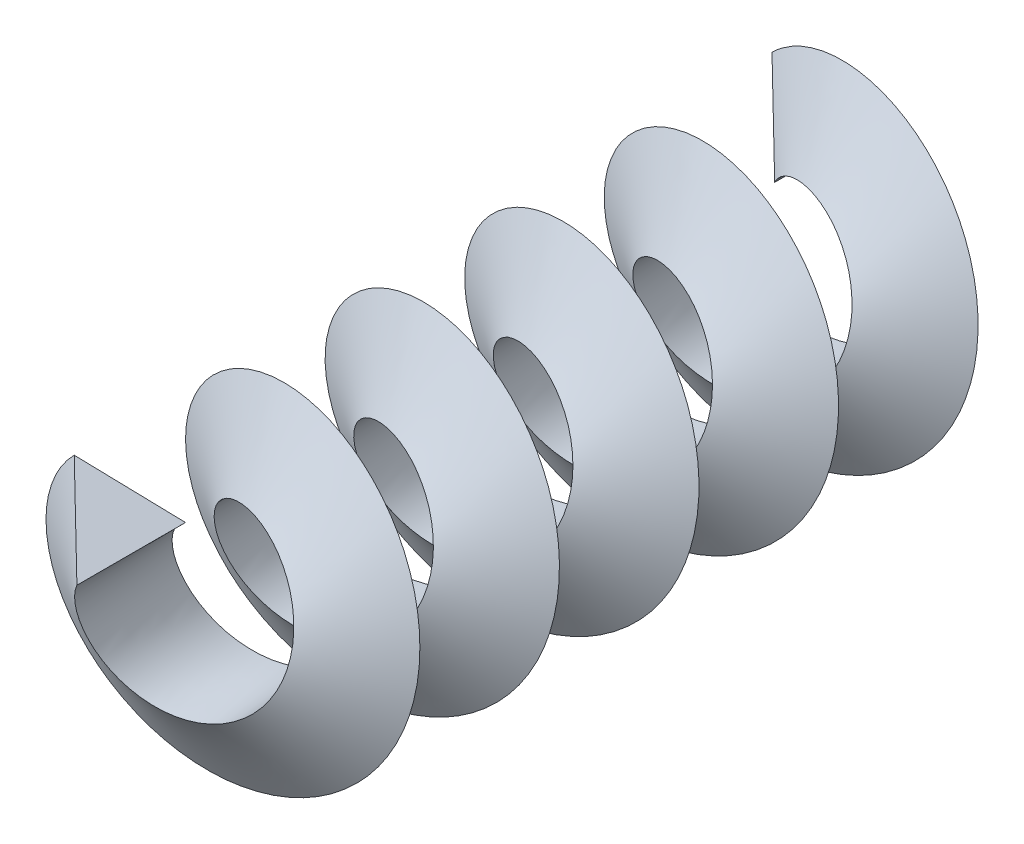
ISO-10303-21;
HEADER;
FILE_DESCRIPTION(('STEP AP214'),'2;1');
FILE_NAME('part.step','',(''),(''),'','','');
FILE_SCHEMA(('AUTOMOTIVE_DESIGN { 1 0 10303 214 1 1 1 1 }'));
ENDSEC;
DATA;
#1=APPLICATION_CONTEXT('core data for automotive mechanical design processes');
#2=APPLICATION_PROTOCOL_DEFINITION('international standard','automotive_design',2000,#1);
#3=PRODUCT_CONTEXT('',#1,'mechanical');
#4=PRODUCT('Part','Part','',(#3));
#5=PRODUCT_RELATED_PRODUCT_CATEGORY('part','',(#4));
#6=PRODUCT_DEFINITION_FORMATION('','',#4);
#7=PRODUCT_DEFINITION_CONTEXT('part definition',#1,'design');
#8=PRODUCT_DEFINITION('design','',#6,#7);
#9=PRODUCT_DEFINITION_SHAPE('','',#8);
#10=(LENGTH_UNIT() NAMED_UNIT(*) SI_UNIT(.MILLI.,.METRE.));
#11=(NAMED_UNIT(*) PLANE_ANGLE_UNIT() SI_UNIT($,.RADIAN.));
#12=(NAMED_UNIT(*) SI_UNIT($,.STERADIAN.) SOLID_ANGLE_UNIT());
#13=UNCERTAINTY_MEASURE_WITH_UNIT(LENGTH_MEASURE(1.E-05),#10,'distance_accuracy_value','');
#14=(GEOMETRIC_REPRESENTATION_CONTEXT(3) GLOBAL_UNCERTAINTY_ASSIGNED_CONTEXT((#13)) GLOBAL_UNIT_ASSIGNED_CONTEXT((#10,
#11,#12)) REPRESENTATION_CONTEXT('',''));
#15=CARTESIAN_POINT('',(0.,0.,0.));
#16=DIRECTION('',(0.,0.,1.));
#17=DIRECTION('',(1.,0.,0.));
#18=AXIS2_PLACEMENT_3D('',#15,#16,#17);
#19=CARTESIAN_POINT('',(-25.5336056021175,16.9302910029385,319.111759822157));
#20=DIRECTION('',(0.673795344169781,0.673795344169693,0.303314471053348));
#21=DIRECTION('',(-0.707106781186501,0.707106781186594,0.));
#22=AXIS2_PLACEMENT_3D('',#19,#20,#21);
#23=PLANE('',#22);
#24=DIRECTION('',(0.505134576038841,-0.719610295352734,0.476445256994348));
#25=VECTOR('',#24,1.);
#26=CARTESIAN_POINT('',(-45.7389886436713,45.7147028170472,300.053949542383));
#27=LINE('',#26,#25);
#28=CARTESIAN_POINT('',(-45.7389886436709,45.7147028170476,300.053949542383));
#29=VERTEX_POINT('',#28);
#30=CARTESIAN_POINT('',(-25.5336056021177,16.9302910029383,319.111759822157));
#31=VERTEX_POINT('',#30);
#32=EDGE_CURVE('E73',#29,#31,#27,.T.);
#33=ORIENTED_EDGE('',*,*,#32,.T.);
#34=DIRECTION('',(0.214475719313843,0.214475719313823,-0.952890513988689));
#35=VECTOR('',#34,1.);
#36=CARTESIAN_POINT('',(-25.5336056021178,16.9302910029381,319.111759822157));
#37=LINE('',#36,#35);
#38=CARTESIAN_POINT('',(-16.9545768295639,25.5093197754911,280.99613926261));
#39=VERTEX_POINT('',#38);
#40=EDGE_CURVE('E69',#31,#39,#37,.T.);
#41=ORIENTED_EDGE('',*,*,#40,.T.);
#42=DIRECTION('',(-0.719610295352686,0.50513457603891,0.476445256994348));
#43=VECTOR('',#42,1.);
#44=CARTESIAN_POINT('',(-16.9545768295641,25.5093197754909,280.99613926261));
#45=LINE('',#44,#43);
#46=EDGE_CURVE('E65',#39,#29,#45,.T.);
#47=ORIENTED_EDGE('',*,*,#46,.T.);
#48=EDGE_LOOP('',(#33,#41,#47));
#49=FACE_BOUND('',#48,.T.);
#50=ADVANCED_FACE('F33',(#49),#23,.T.);
#51=CARTESIAN_POINT('',(-25.533605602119,16.9302910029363,19.1117598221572));
#52=DIRECTION('',(0.673795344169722,0.673795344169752,0.303314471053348));
#53=DIRECTION('',(-0.707106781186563,0.707106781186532,0.));
#54=AXIS2_PLACEMENT_3D('',#51,#52,#53);
#55=PLANE('',#54);
#56=DIRECTION('',(0.505134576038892,-0.719610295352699,0.476445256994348));
#57=VECTOR('',#56,1.);
#58=CARTESIAN_POINT('',(-45.7389886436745,45.714702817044,0.0539495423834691));
#59=LINE('',#58,#57);
#60=CARTESIAN_POINT('',(-45.7389886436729,45.7147028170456,0.0539495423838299));
#61=VERTEX_POINT('',#60);
#62=CARTESIAN_POINT('',(-25.5336056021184,16.9302910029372,19.1117598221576));
#63=VERTEX_POINT('',#62);
#64=EDGE_CURVE('E55',#61,#63,#59,.T.);
#65=ORIENTED_EDGE('',*,*,#64,.F.);
#66=DIRECTION('',(-0.719610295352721,0.50513457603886,0.476445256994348));
#67=VECTOR('',#66,1.);
#68=CARTESIAN_POINT('',(-16.9545768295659,25.5093197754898,-19.0038607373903));
#69=LINE('',#68,#67);
#70=CARTESIAN_POINT('',(-16.954576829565,25.5093197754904,-19.0038607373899));
#71=VERTEX_POINT('',#70);
#72=EDGE_CURVE('E11',#71,#61,#69,.T.);
#73=ORIENTED_EDGE('',*,*,#72,.F.);
#74=DIRECTION('',(0.214475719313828,0.214475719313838,-0.952890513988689));
#75=VECTOR('',#74,1.);
#76=CARTESIAN_POINT('',(-25.533605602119,16.9302910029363,19.1117598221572));
#77=LINE('',#76,#75);
#78=EDGE_CURVE('E40',#63,#71,#77,.T.);
#79=ORIENTED_EDGE('',*,*,#78,.F.);
#80=EDGE_LOOP('',(#65,#73,#79));
#81=FACE_BOUND('',#80,.T.);
#82=ADVANCED_FACE('F109',(#81),#55,.F.);
#83=CARTESIAN_POINT('',(-45.7389886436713,45.7147028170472,300.053949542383));
#84=CARTESIAN_POINT('',(-56.1730712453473,35.2750771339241,297.911092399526));
#85=CARTESIAN_POINT('',(-61.0442710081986,21.3421206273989,295.768235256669));
#86=CARTESIAN_POINT('',(-65.9154707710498,7.40916412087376,293.625378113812));
#87=CARTESIAN_POINT('',(-64.2589868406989,-7.25753029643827,291.482520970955));
#88=CARTESIAN_POINT('',(-62.6025029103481,-21.9242247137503,289.339663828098));
#89=CARTESIAN_POINT('',(-54.7464222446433,-34.4197383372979,287.196806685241));
#90=CARTESIAN_POINT('',(-46.8903415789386,-46.9152519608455,285.053949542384));
#91=CARTESIAN_POINT('',(-34.3906573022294,-54.7646950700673,282.911092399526));
#92=CARTESIAN_POINT('',(-21.8909730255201,-62.6141381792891,280.768235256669));
#93=CARTESIAN_POINT('',(-7.22340090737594,-64.2628322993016,278.625378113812));
#94=CARTESIAN_POINT('',(7.4441712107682,-65.911526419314,276.482520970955));
#95=CARTESIAN_POINT('',(21.3745386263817,-61.0329274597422,274.339663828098));
#96=CARTESIAN_POINT('',(35.3049060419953,-56.1543285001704,272.196806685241));
#97=CARTESIAN_POINT('',(45.7389886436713,-45.7147028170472,270.053949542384));
#98=CARTESIAN_POINT('',(56.1730712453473,-35.2750771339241,267.911092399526));
#99=CARTESIAN_POINT('',(61.0442710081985,-21.3421206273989,265.768235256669));
#100=CARTESIAN_POINT('',(65.9154707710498,-7.40916412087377,263.625378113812));
#101=CARTESIAN_POINT('',(64.2589868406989,7.25753029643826,261.482520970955));
#102=CARTESIAN_POINT('',(62.6025029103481,21.9242247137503,259.339663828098));
#103=CARTESIAN_POINT('',(54.7464222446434,34.4197383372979,257.196806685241));
#104=CARTESIAN_POINT('',(46.8903415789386,46.9152519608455,255.053949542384));
#105=CARTESIAN_POINT('',(34.3906573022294,54.7646950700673,252.911092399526));
#106=CARTESIAN_POINT('',(21.8909730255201,62.6141381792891,250.768235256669));
#107=CARTESIAN_POINT('',(7.22340090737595,64.2628322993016,248.625378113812));
#108=CARTESIAN_POINT('',(-7.44417121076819,65.911526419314,246.482520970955));
#109=CARTESIAN_POINT('',(-21.3745386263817,61.0329274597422,244.339663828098));
#110=CARTESIAN_POINT('',(-35.3049060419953,56.1543285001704,242.196806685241));
#111=CARTESIAN_POINT('',(-45.7389886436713,45.7147028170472,240.053949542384));
#112=CARTESIAN_POINT('',(-56.1730712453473,35.2750771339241,237.911092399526));
#113=CARTESIAN_POINT('',(-61.0442710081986,21.3421206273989,235.768235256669));
#114=CARTESIAN_POINT('',(-65.9154707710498,7.40916412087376,233.625378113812));
#115=CARTESIAN_POINT('',(-64.2589868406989,-7.25753029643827,231.482520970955));
#116=CARTESIAN_POINT('',(-62.6025029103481,-21.9242247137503,229.339663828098));
#117=CARTESIAN_POINT('',(-54.7464222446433,-34.4197383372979,227.196806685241));
#118=CARTESIAN_POINT('',(-46.8903415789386,-46.9152519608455,225.053949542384));
#119=CARTESIAN_POINT('',(-34.3906573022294,-54.7646950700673,222.911092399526));
#120=CARTESIAN_POINT('',(-21.8909730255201,-62.6141381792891,220.768235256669));
#121=CARTESIAN_POINT('',(-7.22340090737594,-64.2628322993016,218.625378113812));
#122=CARTESIAN_POINT('',(7.4441712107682,-65.911526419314,216.482520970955));
#123=CARTESIAN_POINT('',(21.3745386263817,-61.0329274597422,214.339663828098));
#124=CARTESIAN_POINT('',(35.3049060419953,-56.1543285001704,212.196806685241));
#125=CARTESIAN_POINT('',(45.7389886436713,-45.7147028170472,210.053949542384));
#126=CARTESIAN_POINT('',(56.1730712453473,-35.2750771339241,207.911092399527));
#127=CARTESIAN_POINT('',(61.0442710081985,-21.3421206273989,205.768235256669));
#128=CARTESIAN_POINT('',(65.9154707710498,-7.40916412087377,203.625378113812));
#129=CARTESIAN_POINT('',(64.2589868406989,7.25753029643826,201.482520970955));
#130=CARTESIAN_POINT('',(62.6025029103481,21.9242247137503,199.339663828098));
#131=CARTESIAN_POINT('',(54.7464222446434,34.4197383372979,197.196806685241));
#132=CARTESIAN_POINT('',(46.8903415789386,46.9152519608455,195.053949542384));
#133=CARTESIAN_POINT('',(34.3906573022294,54.7646950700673,192.911092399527));
#134=CARTESIAN_POINT('',(21.8909730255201,62.6141381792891,190.768235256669));
#135=CARTESIAN_POINT('',(7.22340090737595,64.2628322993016,188.625378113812));
#136=CARTESIAN_POINT('',(-7.44417121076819,65.911526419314,186.482520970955));
#137=CARTESIAN_POINT('',(-21.3745386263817,61.0329274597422,184.339663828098));
#138=CARTESIAN_POINT('',(-35.3049060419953,56.1543285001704,182.196806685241));
#139=CARTESIAN_POINT('',(-45.7389886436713,45.7147028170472,180.053949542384));
#140=CARTESIAN_POINT('',(-56.1730712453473,35.2750771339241,177.911092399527));
#141=CARTESIAN_POINT('',(-61.0442710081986,21.3421206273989,175.768235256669));
#142=CARTESIAN_POINT('',(-65.9154707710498,7.40916412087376,173.625378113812));
#143=CARTESIAN_POINT('',(-64.2589868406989,-7.25753029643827,171.482520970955));
#144=CARTESIAN_POINT('',(-62.6025029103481,-21.9242247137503,169.339663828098));
#145=CARTESIAN_POINT('',(-54.7464222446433,-34.4197383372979,167.196806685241));
#146=CARTESIAN_POINT('',(-46.8903415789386,-46.9152519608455,165.053949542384));
#147=CARTESIAN_POINT('',(-34.3906573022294,-54.7646950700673,162.911092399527));
#148=CARTESIAN_POINT('',(-21.8909730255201,-62.6141381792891,160.768235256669));
#149=CARTESIAN_POINT('',(-7.22340090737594,-64.2628322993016,158.625378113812));
#150=CARTESIAN_POINT('',(7.4441712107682,-65.911526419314,156.482520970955));
#151=CARTESIAN_POINT('',(21.3745386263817,-61.0329274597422,154.339663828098));
#152=CARTESIAN_POINT('',(35.3049060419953,-56.1543285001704,152.196806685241));
#153=CARTESIAN_POINT('',(45.7389886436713,-45.7147028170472,150.053949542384));
#154=CARTESIAN_POINT('',(56.1730712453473,-35.2750771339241,147.911092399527));
#155=CARTESIAN_POINT('',(61.0442710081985,-21.3421206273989,145.76823525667));
#156=CARTESIAN_POINT('',(65.9154707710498,-7.40916412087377,143.625378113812));
#157=CARTESIAN_POINT('',(64.2589868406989,7.25753029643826,141.482520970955));
#158=CARTESIAN_POINT('',(62.6025029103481,21.9242247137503,139.339663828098));
#159=CARTESIAN_POINT('',(54.7464222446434,34.4197383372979,137.196806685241));
#160=CARTESIAN_POINT('',(46.8903415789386,46.9152519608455,135.053949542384));
#161=CARTESIAN_POINT('',(34.3906573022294,54.7646950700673,132.911092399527));
#162=CARTESIAN_POINT('',(21.8909730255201,62.6141381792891,130.76823525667));
#163=CARTESIAN_POINT('',(7.22340090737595,64.2628322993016,128.625378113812));
#164=CARTESIAN_POINT('',(-7.44417121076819,65.911526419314,126.482520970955));
#165=CARTESIAN_POINT('',(-21.3745386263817,61.0329274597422,124.339663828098));
#166=CARTESIAN_POINT('',(-35.3049060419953,56.1543285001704,122.196806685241));
#167=CARTESIAN_POINT('',(-45.7389886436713,45.7147028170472,120.053949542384));
#168=CARTESIAN_POINT('',(-56.1730712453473,35.2750771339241,117.911092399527));
#169=CARTESIAN_POINT('',(-61.0442710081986,21.3421206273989,115.76823525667));
#170=CARTESIAN_POINT('',(-65.9154707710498,7.40916412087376,113.625378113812));
#171=CARTESIAN_POINT('',(-64.2589868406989,-7.25753029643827,111.482520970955));
#172=CARTESIAN_POINT('',(-62.6025029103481,-21.9242247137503,109.339663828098));
#173=CARTESIAN_POINT('',(-54.7464222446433,-34.4197383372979,107.196806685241));
#174=CARTESIAN_POINT('',(-46.8903415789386,-46.9152519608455,105.053949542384));
#175=CARTESIAN_POINT('',(-34.3906573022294,-54.7646950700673,102.911092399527));
#176=CARTESIAN_POINT('',(-21.8909730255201,-62.6141381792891,100.76823525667));
#177=CARTESIAN_POINT('',(-7.22340090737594,-64.2628322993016,98.6253781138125));
#178=CARTESIAN_POINT('',(7.4441712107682,-65.911526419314,96.4825209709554));
#179=CARTESIAN_POINT('',(21.3745386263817,-61.0329274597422,94.3396638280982));
#180=CARTESIAN_POINT('',(35.3049060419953,-56.1543285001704,92.1968066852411));
#181=CARTESIAN_POINT('',(45.7389886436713,-45.7147028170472,90.053949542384));
#182=CARTESIAN_POINT('',(56.1730712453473,-35.2750771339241,87.9110923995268));
#183=CARTESIAN_POINT('',(61.0442710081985,-21.3421206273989,85.7682352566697));
#184=CARTESIAN_POINT('',(65.9154707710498,-7.40916412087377,83.6253781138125));
#185=CARTESIAN_POINT('',(64.2589868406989,7.25753029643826,81.4825209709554));
#186=CARTESIAN_POINT('',(62.6025029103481,21.9242247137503,79.3396638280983));
#187=CARTESIAN_POINT('',(54.7464222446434,34.4197383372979,77.1968066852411));
#188=CARTESIAN_POINT('',(46.8903415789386,46.9152519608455,75.053949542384));
#189=CARTESIAN_POINT('',(34.3906573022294,54.7646950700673,72.9110923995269));
#190=CARTESIAN_POINT('',(21.8909730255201,62.6141381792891,70.7682352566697));
#191=CARTESIAN_POINT('',(7.22340090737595,64.2628322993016,68.6253781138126));
#192=CARTESIAN_POINT('',(-7.44417121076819,65.911526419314,66.4825209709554));
#193=CARTESIAN_POINT('',(-21.3745386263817,61.0329274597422,64.3396638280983));
#194=CARTESIAN_POINT('',(-35.3049060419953,56.1543285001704,62.1968066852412));
#195=CARTESIAN_POINT('',(-45.7389886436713,45.7147028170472,60.053949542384));
#196=CARTESIAN_POINT('',(-56.1730712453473,35.2750771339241,57.9110923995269));
#197=CARTESIAN_POINT('',(-61.0442710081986,21.3421206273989,55.7682352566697));
#198=CARTESIAN_POINT('',(-65.9154707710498,7.40916412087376,53.6253781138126));
#199=CARTESIAN_POINT('',(-64.2589868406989,-7.25753029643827,51.4825209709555));
#200=CARTESIAN_POINT('',(-62.6025029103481,-21.9242247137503,49.3396638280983));
#201=CARTESIAN_POINT('',(-54.7464222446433,-34.4197383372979,47.1968066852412));
#202=CARTESIAN_POINT('',(-46.8903415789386,-46.9152519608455,45.0539495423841));
#203=CARTESIAN_POINT('',(-34.3906573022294,-54.7646950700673,42.911092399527));
#204=CARTESIAN_POINT('',(-21.8909730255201,-62.6141381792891,40.7682352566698));
#205=CARTESIAN_POINT('',(-7.22340090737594,-64.2628322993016,38.6253781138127));
#206=CARTESIAN_POINT('',(7.4441712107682,-65.911526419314,36.4825209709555));
#207=CARTESIAN_POINT('',(21.3745386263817,-61.0329274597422,34.3396638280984));
#208=CARTESIAN_POINT('',(35.3049060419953,-56.1543285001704,32.1968066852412));
#209=CARTESIAN_POINT('',(45.7389886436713,-45.7147028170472,30.0539495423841));
#210=CARTESIAN_POINT('',(56.1730712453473,-35.2750771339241,27.9110923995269));
#211=CARTESIAN_POINT('',(61.0442710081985,-21.3421206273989,25.7682352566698));
#212=CARTESIAN_POINT('',(65.9154707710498,-7.40916412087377,23.6253781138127));
#213=CARTESIAN_POINT('',(64.2589868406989,7.25753029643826,21.4825209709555));
#214=CARTESIAN_POINT('',(62.6025029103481,21.9242247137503,19.3396638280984));
#215=CARTESIAN_POINT('',(54.7464222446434,34.4197383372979,17.1968066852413));
#216=CARTESIAN_POINT('',(46.8903415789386,46.9152519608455,15.0539495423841));
#217=CARTESIAN_POINT('',(34.3906573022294,54.7646950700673,12.911092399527));
#218=CARTESIAN_POINT('',(21.8909730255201,62.6141381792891,10.7682352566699));
#219=CARTESIAN_POINT('',(7.22340090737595,64.2628322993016,8.6253781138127));
#220=CARTESIAN_POINT('',(-7.44417121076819,65.911526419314,6.48252097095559));
#221=CARTESIAN_POINT('',(-21.3745386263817,61.0329274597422,4.33966382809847));
#222=CARTESIAN_POINT('',(-35.3049060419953,56.1543285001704,2.1968066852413));
#223=CARTESIAN_POINT('',(-45.7389886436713,45.7147028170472,0.0539495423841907));
#224=CARTESIAN_POINT('',(-25.5336056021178,16.9302910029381,319.111759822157));
#225=CARTESIAN_POINT('',(-29.3978340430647,11.1024121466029,316.9689026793));
#226=CARTESIAN_POINT('',(-30.3507616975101,4.1750488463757,314.826045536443));
#227=CARTESIAN_POINT('',(-31.3036893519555,-2.75231445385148,312.683188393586));
#228=CARTESIAN_POINT('',(-29.1565772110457,-9.40711293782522,310.540331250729));
#229=CARTESIAN_POINT('',(-27.0094650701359,-16.061911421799,308.397474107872));
#230=CARTESIAN_POINT('',(-22.1875750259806,-21.1260806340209,306.254616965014));
#231=CARTESIAN_POINT('',(-17.3656849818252,-26.1902498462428,304.111759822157));
#232=CARTESIAN_POINT('',(-10.8240514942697,-28.6607689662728,301.9689026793));
#233=CARTESIAN_POINT('',(-4.28241800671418,-31.1312880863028,299.826045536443));
#234=CARTESIAN_POINT('',(2.68330818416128,-30.5188405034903,297.683188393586));
#235=CARTESIAN_POINT('',(9.64903437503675,-29.9063929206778,295.540331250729));
#236=CARTESIAN_POINT('',(15.6592057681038,-26.3322813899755,293.397474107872));
#237=CARTESIAN_POINT('',(21.6693771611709,-22.7581698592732,291.254616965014));
#238=CARTESIAN_POINT('',(25.5336056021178,-16.9302910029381,289.111759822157));
#239=CARTESIAN_POINT('',(29.3978340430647,-11.1024121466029,286.9689026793));
#240=CARTESIAN_POINT('',(30.3507616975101,-4.1750488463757,284.826045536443));
#241=CARTESIAN_POINT('',(31.3036893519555,2.75231445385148,282.683188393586));
#242=CARTESIAN_POINT('',(29.1565772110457,9.40711293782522,280.540331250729));
#243=CARTESIAN_POINT('',(27.0094650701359,16.061911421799,278.397474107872));
#244=CARTESIAN_POINT('',(22.1875750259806,21.1260806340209,276.254616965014));
#245=CARTESIAN_POINT('',(17.3656849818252,26.1902498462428,274.111759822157));
#246=CARTESIAN_POINT('',(10.8240514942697,28.6607689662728,271.9689026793));
#247=CARTESIAN_POINT('',(4.28241800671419,31.1312880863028,269.826045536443));
#248=CARTESIAN_POINT('',(-2.68330818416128,30.5188405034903,267.683188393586));
#249=CARTESIAN_POINT('',(-9.64903437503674,29.9063929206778,265.540331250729));
#250=CARTESIAN_POINT('',(-15.6592057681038,26.3322813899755,263.397474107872));
#251=CARTESIAN_POINT('',(-21.6693771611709,22.7581698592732,261.254616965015));
#252=CARTESIAN_POINT('',(-25.5336056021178,16.9302910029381,259.111759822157));
#253=CARTESIAN_POINT('',(-29.3978340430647,11.1024121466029,256.9689026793));
#254=CARTESIAN_POINT('',(-30.3507616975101,4.1750488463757,254.826045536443));
#255=CARTESIAN_POINT('',(-31.3036893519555,-2.75231445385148,252.683188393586));
#256=CARTESIAN_POINT('',(-29.1565772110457,-9.40711293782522,250.540331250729));
#257=CARTESIAN_POINT('',(-27.0094650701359,-16.061911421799,248.397474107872));
#258=CARTESIAN_POINT('',(-22.1875750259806,-21.1260806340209,246.254616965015));
#259=CARTESIAN_POINT('',(-17.3656849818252,-26.1902498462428,244.111759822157));
#260=CARTESIAN_POINT('',(-10.8240514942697,-28.6607689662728,241.9689026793));
#261=CARTESIAN_POINT('',(-4.28241800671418,-31.1312880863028,239.826045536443));
#262=CARTESIAN_POINT('',(2.68330818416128,-30.5188405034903,237.683188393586));
#263=CARTESIAN_POINT('',(9.64903437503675,-29.9063929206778,235.540331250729));
#264=CARTESIAN_POINT('',(15.6592057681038,-26.3322813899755,233.397474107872));
#265=CARTESIAN_POINT('',(21.6693771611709,-22.7581698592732,231.254616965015));
#266=CARTESIAN_POINT('',(25.5336056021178,-16.9302910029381,229.111759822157));
#267=CARTESIAN_POINT('',(29.3978340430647,-11.1024121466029,226.9689026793));
#268=CARTESIAN_POINT('',(30.3507616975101,-4.1750488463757,224.826045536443));
#269=CARTESIAN_POINT('',(31.3036893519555,2.75231445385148,222.683188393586));
#270=CARTESIAN_POINT('',(29.1565772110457,9.40711293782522,220.540331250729));
#271=CARTESIAN_POINT('',(27.0094650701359,16.061911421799,218.397474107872));
#272=CARTESIAN_POINT('',(22.1875750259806,21.1260806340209,216.254616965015));
#273=CARTESIAN_POINT('',(17.3656849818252,26.1902498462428,214.111759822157));
#274=CARTESIAN_POINT('',(10.8240514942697,28.6607689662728,211.9689026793));
#275=CARTESIAN_POINT('',(4.28241800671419,31.1312880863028,209.826045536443));
#276=CARTESIAN_POINT('',(-2.68330818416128,30.5188405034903,207.683188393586));
#277=CARTESIAN_POINT('',(-9.64903437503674,29.9063929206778,205.540331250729));
#278=CARTESIAN_POINT('',(-15.6592057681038,26.3322813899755,203.397474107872));
#279=CARTESIAN_POINT('',(-21.6693771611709,22.7581698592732,201.254616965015));
#280=CARTESIAN_POINT('',(-25.5336056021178,16.9302910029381,199.111759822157));
#281=CARTESIAN_POINT('',(-29.3978340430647,11.1024121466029,196.9689026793));
#282=CARTESIAN_POINT('',(-30.3507616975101,4.1750488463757,194.826045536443));
#283=CARTESIAN_POINT('',(-31.3036893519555,-2.75231445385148,192.683188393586));
#284=CARTESIAN_POINT('',(-29.1565772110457,-9.40711293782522,190.540331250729));
#285=CARTESIAN_POINT('',(-27.0094650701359,-16.061911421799,188.397474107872));
#286=CARTESIAN_POINT('',(-22.1875750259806,-21.1260806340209,186.254616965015));
#287=CARTESIAN_POINT('',(-17.3656849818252,-26.1902498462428,184.111759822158));
#288=CARTESIAN_POINT('',(-10.8240514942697,-28.6607689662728,181.9689026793));
#289=CARTESIAN_POINT('',(-4.28241800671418,-31.1312880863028,179.826045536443));
#290=CARTESIAN_POINT('',(2.68330818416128,-30.5188405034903,177.683188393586));
#291=CARTESIAN_POINT('',(9.64903437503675,-29.9063929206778,175.540331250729));
#292=CARTESIAN_POINT('',(15.6592057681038,-26.3322813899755,173.397474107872));
#293=CARTESIAN_POINT('',(21.6693771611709,-22.7581698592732,171.254616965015));
#294=CARTESIAN_POINT('',(25.5336056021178,-16.9302910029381,169.111759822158));
#295=CARTESIAN_POINT('',(29.3978340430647,-11.1024121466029,166.9689026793));
#296=CARTESIAN_POINT('',(30.3507616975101,-4.1750488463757,164.826045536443));
#297=CARTESIAN_POINT('',(31.3036893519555,2.75231445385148,162.683188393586));
#298=CARTESIAN_POINT('',(29.1565772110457,9.40711293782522,160.540331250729));
#299=CARTESIAN_POINT('',(27.0094650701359,16.061911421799,158.397474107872));
#300=CARTESIAN_POINT('',(22.1875750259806,21.1260806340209,156.254616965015));
#301=CARTESIAN_POINT('',(17.3656849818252,26.1902498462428,154.111759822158));
#302=CARTESIAN_POINT('',(10.8240514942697,28.6607689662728,151.9689026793));
#303=CARTESIAN_POINT('',(4.28241800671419,31.1312880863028,149.826045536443));
#304=CARTESIAN_POINT('',(-2.68330818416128,30.5188405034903,147.683188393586));
#305=CARTESIAN_POINT('',(-9.64903437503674,29.9063929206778,145.540331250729));
#306=CARTESIAN_POINT('',(-15.6592057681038,26.3322813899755,143.397474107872));
#307=CARTESIAN_POINT('',(-21.6693771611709,22.7581698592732,141.254616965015));
#308=CARTESIAN_POINT('',(-25.5336056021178,16.9302910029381,139.111759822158));
#309=CARTESIAN_POINT('',(-29.3978340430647,11.1024121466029,136.9689026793));
#310=CARTESIAN_POINT('',(-30.3507616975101,4.1750488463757,134.826045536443));
#311=CARTESIAN_POINT('',(-31.3036893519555,-2.75231445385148,132.683188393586));
#312=CARTESIAN_POINT('',(-29.1565772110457,-9.40711293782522,130.540331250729));
#313=CARTESIAN_POINT('',(-27.0094650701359,-16.061911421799,128.397474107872));
#314=CARTESIAN_POINT('',(-22.1875750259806,-21.1260806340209,126.254616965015));
#315=CARTESIAN_POINT('',(-17.3656849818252,-26.1902498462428,124.111759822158));
#316=CARTESIAN_POINT('',(-10.8240514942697,-28.6607689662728,121.968902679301));
#317=CARTESIAN_POINT('',(-4.28241800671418,-31.1312880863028,119.826045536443));
#318=CARTESIAN_POINT('',(2.68330818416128,-30.5188405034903,117.683188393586));
#319=CARTESIAN_POINT('',(9.64903437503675,-29.9063929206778,115.540331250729));
#320=CARTESIAN_POINT('',(15.6592057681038,-26.3322813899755,113.397474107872));
#321=CARTESIAN_POINT('',(21.6693771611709,-22.7581698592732,111.254616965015));
#322=CARTESIAN_POINT('',(25.5336056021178,-16.9302910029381,109.111759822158));
#323=CARTESIAN_POINT('',(29.3978340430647,-11.1024121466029,106.968902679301));
#324=CARTESIAN_POINT('',(30.3507616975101,-4.1750488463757,104.826045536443));
#325=CARTESIAN_POINT('',(31.3036893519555,2.75231445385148,102.683188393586));
#326=CARTESIAN_POINT('',(29.1565772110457,9.40711293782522,100.540331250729));
#327=CARTESIAN_POINT('',(27.0094650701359,16.061911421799,98.397474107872));
#328=CARTESIAN_POINT('',(22.1875750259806,21.1260806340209,96.2546169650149));
#329=CARTESIAN_POINT('',(17.3656849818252,26.1902498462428,94.1117598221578));
#330=CARTESIAN_POINT('',(10.8240514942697,28.6607689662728,91.9689026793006));
#331=CARTESIAN_POINT('',(4.28241800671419,31.1312880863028,89.8260455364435));
#332=CARTESIAN_POINT('',(-2.68330818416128,30.5188405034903,87.6831883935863));
#333=CARTESIAN_POINT('',(-9.64903437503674,29.9063929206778,85.5403312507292));
#334=CARTESIAN_POINT('',(-15.6592057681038,26.3322813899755,83.3974741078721));
#335=CARTESIAN_POINT('',(-21.6693771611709,22.7581698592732,81.2546169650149));
#336=CARTESIAN_POINT('',(-25.5336056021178,16.9302910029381,79.1117598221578));
#337=CARTESIAN_POINT('',(-29.3978340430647,11.1024121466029,76.9689026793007));
#338=CARTESIAN_POINT('',(-30.3507616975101,4.1750488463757,74.8260455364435));
#339=CARTESIAN_POINT('',(-31.3036893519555,-2.75231445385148,72.6831883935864));
#340=CARTESIAN_POINT('',(-29.1565772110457,-9.40711293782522,70.5403312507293));
#341=CARTESIAN_POINT('',(-27.0094650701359,-16.061911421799,68.3974741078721));
#342=CARTESIAN_POINT('',(-22.1875750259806,-21.1260806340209,66.2546169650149));
#343=CARTESIAN_POINT('',(-17.3656849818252,-26.1902498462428,64.1117598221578));
#344=CARTESIAN_POINT('',(-10.8240514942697,-28.6607689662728,61.9689026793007));
#345=CARTESIAN_POINT('',(-4.28241800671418,-31.1312880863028,59.8260455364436));
#346=CARTESIAN_POINT('',(2.68330818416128,-30.5188405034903,57.6831883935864));
#347=CARTESIAN_POINT('',(9.64903437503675,-29.9063929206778,55.5403312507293));
#348=CARTESIAN_POINT('',(15.6592057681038,-26.3322813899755,53.3974741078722));
#349=CARTESIAN_POINT('',(21.6693771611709,-22.7581698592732,51.254616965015));
#350=CARTESIAN_POINT('',(25.5336056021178,-16.9302910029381,49.1117598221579));
#351=CARTESIAN_POINT('',(29.3978340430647,-11.1024121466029,46.9689026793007));
#352=CARTESIAN_POINT('',(30.3507616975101,-4.1750488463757,44.8260455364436));
#353=CARTESIAN_POINT('',(31.3036893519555,2.75231445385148,42.6831883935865));
#354=CARTESIAN_POINT('',(29.1565772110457,9.40711293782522,40.5403312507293));
#355=CARTESIAN_POINT('',(27.0094650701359,16.061911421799,38.3974741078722));
#356=CARTESIAN_POINT('',(22.1875750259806,21.1260806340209,36.254616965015));
#357=CARTESIAN_POINT('',(17.3656849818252,26.1902498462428,34.1117598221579));
#358=CARTESIAN_POINT('',(10.8240514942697,28.6607689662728,31.9689026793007));
#359=CARTESIAN_POINT('',(4.28241800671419,31.1312880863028,29.8260455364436));
#360=CARTESIAN_POINT('',(-2.68330818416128,30.5188405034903,27.6831883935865));
#361=CARTESIAN_POINT('',(-9.64903437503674,29.9063929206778,25.5403312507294));
#362=CARTESIAN_POINT('',(-15.6592057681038,26.3322813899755,23.3974741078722));
#363=CARTESIAN_POINT('',(-21.6693771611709,22.7581698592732,21.2546169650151));
#364=CARTESIAN_POINT('',(-25.5336056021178,16.9302910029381,19.111759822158));
#365=(BOUNDED_SURFACE() B_SPLINE_SURFACE(1,2,((#83,#84,#85,#86,#87,#88,#89,#90,#91,#92,#93,#94,
#95,#96,#97,#98,#99,#100,#101,#102,#103,#104,#105,#106,#107,#108,#109,#110,#111,#112,#113,#114,
#115,#116,#117,#118,#119,#120,#121,#122,#123,#124,#125,#126,#127,#128,#129,#130,#131,#132,#133,
#134,#135,#136,#137,#138,#139,#140,#141,#142,#143,#144,#145,#146,#147,#148,#149,#150,#151,#152,
#153,#154,#155,#156,#157,#158,#159,#160,#161,#162,#163,#164,#165,#166,#167,#168,#169,#170,#171,
#172,#173,#174,#175,#176,#177,#178,#179,#180,#181,#182,#183,#184,#185,#186,#187,#188,#189,#190,
#191,#192,#193,#194,#195,#196,#197,#198,#199,#200,#201,#202,#203,#204,#205,#206,#207,#208,#209,
#210,#211,#212,#213,#214,#215,#216,#217,#218,#219,#220,#221,#222,#223),(#224,#225,#226,#227,
#228,#229,#230,#231,#232,#233,#234,#235,#236,#237,#238,#239,#240,#241,#242,#243,#244,#245,#246,
#247,#248,#249,#250,#251,#252,#253,#254,#255,#256,#257,#258,#259,#260,#261,#262,#263,#264,#265,
#266,#267,#268,#269,#270,#271,#272,#273,#274,#275,#276,#277,#278,#279,#280,#281,#282,#283,#284,
#285,#286,#287,#288,#289,#290,#291,#292,#293,#294,#295,#296,#297,#298,#299,#300,#301,#302,#303,
#304,#305,#306,#307,#308,#309,#310,#311,#312,#313,#314,#315,#316,#317,#318,#319,#320,#321,#322,
#323,#324,#325,#326,#327,#328,#329,#330,#331,#332,#333,#334,#335,#336,#337,#338,#339,#340,#341,
#342,#343,#344,#345,#346,#347,#348,#349,#350,#351,#352,#353,#354,#355,#356,#357,#358,#359,#360,
#361,#362,#363,#364)),.UNSPECIFIED.,.F.,.F.,.F.) B_SPLINE_SURFACE_WITH_KNOTS((2,2),(3,2,2,2,2,2,
2,2,2,2,2,2,2,2,2,2,2,2,2,2,2,2,2,2,2,2,2,2,2,2,2,2,2,2,2,2,2,2,2,2,2,2,2,2,2,2,2,2,2,2,2,2,2,2,
2,2,2,2,2,2,2,2,2,2,2,2,2,2,2,2,3),(0.,1.),(0.,0.0142857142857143,0.0285714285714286,
0.0428571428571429,0.0571428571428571,0.0714285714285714,0.0857142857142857,0.1,
0.114285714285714,0.128571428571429,0.142857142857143,0.157142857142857,0.171428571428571,
0.185714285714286,0.2,0.214285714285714,0.228571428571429,0.242857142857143,0.257142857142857,
0.271428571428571,0.285714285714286,0.3,0.314285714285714,0.328571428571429,0.342857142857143,
0.357142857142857,0.371428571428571,0.385714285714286,0.4,0.414285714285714,0.428571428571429,
0.442857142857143,0.457142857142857,0.471428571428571,0.485714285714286,0.5,0.514285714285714,
0.528571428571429,0.542857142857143,0.557142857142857,0.571428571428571,0.585714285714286,0.6,
0.614285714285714,0.628571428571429,0.642857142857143,0.657142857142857,0.671428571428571,
0.685714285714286,0.7,0.714285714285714,0.728571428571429,0.742857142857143,0.757142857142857,
0.771428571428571,0.785714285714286,0.8,0.814285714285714,0.828571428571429,0.842857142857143,
0.857142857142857,0.871428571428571,0.885714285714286,0.9,0.914285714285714,0.928571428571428,
0.942857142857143,0.957142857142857,0.971428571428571,0.985714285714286,1.),
.UNSPECIFIED.) GEOMETRIC_REPRESENTATION_ITEM() RATIONAL_B_SPLINE_SURFACE(((1.,0.974927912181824,
1.,0.974927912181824,1.,0.974927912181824,1.,0.974927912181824,1.,0.974927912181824,1.,
0.974927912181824,1.,0.974927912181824,1.,0.974927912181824,1.,0.974927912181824,1.,
0.974927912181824,1.,0.974927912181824,1.,0.974927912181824,1.,0.974927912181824,1.,
0.974927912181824,1.,0.974927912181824,1.,0.974927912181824,1.,0.974927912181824,1.,
0.974927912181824,1.,0.974927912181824,1.,0.974927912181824,1.,0.974927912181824,1.,
0.974927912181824,1.,0.974927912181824,1.,0.974927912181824,1.,0.974927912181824,1.,
0.974927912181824,1.,0.974927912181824,1.,0.974927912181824,1.,0.974927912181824,1.,
0.974927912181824,1.,0.974927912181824,1.,0.974927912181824,1.,0.974927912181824,1.,
0.974927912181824,1.,0.974927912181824,1.,0.974927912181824,1.,0.974927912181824,1.,
0.974927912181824,1.,0.974927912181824,1.,0.974927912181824,1.,0.974927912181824,1.,
0.974927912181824,1.,0.974927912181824,1.,0.974927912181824,1.,0.974927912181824,1.,
0.974927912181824,1.,0.974927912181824,1.,0.974927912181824,1.,0.974927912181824,1.,
0.974927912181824,1.,0.974927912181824,1.,0.974927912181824,1.,0.974927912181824,1.,
0.974927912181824,1.,0.974927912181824,1.,0.974927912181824,1.,0.974927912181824,1.,
0.974927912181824,1.,0.974927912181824,1.,0.974927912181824,1.,0.974927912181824,1.,
0.974927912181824,1.,0.974927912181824,1.,0.974927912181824,1.,0.974927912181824,1.,
0.974927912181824,1.,0.974927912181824,1.,0.974927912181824,1.,0.974927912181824,1.,
0.974927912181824,1.),(1.,0.974927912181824,1.,0.974927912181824,1.,0.974927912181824,1.,
0.974927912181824,1.,0.974927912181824,1.,0.974927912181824,1.,0.974927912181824,1.,
0.974927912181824,1.,0.974927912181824,1.,0.974927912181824,1.,0.974927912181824,1.,
0.974927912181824,1.,0.974927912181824,1.,0.974927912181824,1.,0.974927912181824,1.,
0.974927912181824,1.,0.974927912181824,1.,0.974927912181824,1.,0.974927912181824,1.,
0.974927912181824,1.,0.974927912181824,1.,0.974927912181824,1.,0.974927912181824,1.,
0.974927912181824,1.,0.974927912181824,1.,0.974927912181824,1.,0.974927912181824,1.,
0.974927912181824,1.,0.974927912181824,1.,0.974927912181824,1.,0.974927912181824,1.,
0.974927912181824,1.,0.974927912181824,1.,0.974927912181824,1.,0.974927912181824,1.,
0.974927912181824,1.,0.974927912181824,1.,0.974927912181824,1.,0.974927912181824,1.,
0.974927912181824,1.,0.974927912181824,1.,0.974927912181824,1.,0.974927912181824,1.,
0.974927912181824,1.,0.974927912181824,1.,0.974927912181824,1.,0.974927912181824,1.,
0.974927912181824,1.,0.974927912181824,1.,0.974927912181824,1.,0.974927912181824,1.,
0.974927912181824,1.,0.974927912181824,1.,0.974927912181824,1.,0.974927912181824,1.,
0.974927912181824,1.,0.974927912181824,1.,0.974927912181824,1.,0.974927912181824,1.,
0.974927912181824,1.,0.974927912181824,1.,0.974927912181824,1.,0.974927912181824,1.,
0.974927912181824,1.,0.974927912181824,1.,0.974927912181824,1.,0.974927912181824,1.,
0.974927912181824,1.,0.974927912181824,1.,0.974927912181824,1.))) REPRESENTATION_ITEM('') SURFACE());
#366=CARTESIAN_POINT('',(-25.5336056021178,16.9302910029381,319.111759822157));
#367=CARTESIAN_POINT('',(-29.3978340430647,11.1024121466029,316.9689026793));
#368=CARTESIAN_POINT('',(-30.3507616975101,4.1750488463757,314.826045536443));
#369=CARTESIAN_POINT('',(-31.3036893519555,-2.75231445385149,312.683188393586));
#370=CARTESIAN_POINT('',(-29.1565772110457,-9.40711293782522,310.540331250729));
#371=CARTESIAN_POINT('',(-27.0094650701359,-16.061911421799,308.397474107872));
#372=CARTESIAN_POINT('',(-22.1875750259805,-21.1260806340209,306.254616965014));
#373=CARTESIAN_POINT('',(-17.3656849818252,-26.1902498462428,304.111759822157));
#374=CARTESIAN_POINT('',(-10.8240514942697,-28.6607689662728,301.9689026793));
#375=CARTESIAN_POINT('',(-4.28241800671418,-31.1312880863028,299.826045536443));
#376=CARTESIAN_POINT('',(2.68330818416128,-30.5188405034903,297.683188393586));
#377=CARTESIAN_POINT('',(9.64903437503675,-29.9063929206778,295.540331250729));
#378=CARTESIAN_POINT('',(15.6592057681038,-26.3322813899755,293.397474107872));
#379=CARTESIAN_POINT('',(21.6693771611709,-22.7581698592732,291.254616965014));
#380=CARTESIAN_POINT('',(25.5336056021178,-16.9302910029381,289.111759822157));
#381=CARTESIAN_POINT('',(29.3978340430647,-11.1024121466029,286.9689026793));
#382=CARTESIAN_POINT('',(30.3507616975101,-4.1750488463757,284.826045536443));
#383=CARTESIAN_POINT('',(31.3036893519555,2.75231445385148,282.683188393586));
#384=CARTESIAN_POINT('',(29.1565772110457,9.40711293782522,280.540331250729));
#385=CARTESIAN_POINT('',(27.0094650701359,16.061911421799,278.397474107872));
#386=CARTESIAN_POINT('',(22.1875750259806,21.1260806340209,276.254616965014));
#387=CARTESIAN_POINT('',(17.3656849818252,26.1902498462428,274.111759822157));
#388=CARTESIAN_POINT('',(10.8240514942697,28.6607689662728,271.9689026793));
#389=CARTESIAN_POINT('',(4.28241800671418,31.1312880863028,269.826045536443));
#390=CARTESIAN_POINT('',(-2.68330818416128,30.5188405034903,267.683188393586));
#391=CARTESIAN_POINT('',(-9.64903437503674,29.9063929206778,265.540331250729));
#392=CARTESIAN_POINT('',(-15.6592057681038,26.3322813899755,263.397474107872));
#393=CARTESIAN_POINT('',(-21.6693771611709,22.7581698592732,261.254616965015));
#394=CARTESIAN_POINT('',(-25.5336056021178,16.9302910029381,259.111759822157));
#395=CARTESIAN_POINT('',(-29.3978340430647,11.1024121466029,256.9689026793));
#396=CARTESIAN_POINT('',(-30.3507616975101,4.17504884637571,254.826045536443));
#397=CARTESIAN_POINT('',(-31.3036893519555,-2.75231445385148,252.683188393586));
#398=CARTESIAN_POINT('',(-29.1565772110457,-9.40711293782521,250.540331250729));
#399=CARTESIAN_POINT('',(-27.0094650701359,-16.0619114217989,248.397474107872));
#400=CARTESIAN_POINT('',(-22.1875750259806,-21.1260806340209,246.254616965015));
#401=CARTESIAN_POINT('',(-17.3656849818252,-26.1902498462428,244.111759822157));
#402=CARTESIAN_POINT('',(-10.8240514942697,-28.6607689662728,241.9689026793));
#403=CARTESIAN_POINT('',(-4.28241800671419,-31.1312880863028,239.826045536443));
#404=CARTESIAN_POINT('',(2.68330818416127,-30.5188405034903,237.683188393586));
#405=CARTESIAN_POINT('',(9.64903437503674,-29.9063929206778,235.540331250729));
#406=CARTESIAN_POINT('',(15.6592057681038,-26.3322813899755,233.397474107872));
#407=CARTESIAN_POINT('',(21.6693771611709,-22.7581698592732,231.254616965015));
#408=CARTESIAN_POINT('',(25.5336056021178,-16.9302910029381,229.111759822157));
#409=CARTESIAN_POINT('',(29.3978340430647,-11.1024121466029,226.9689026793));
#410=CARTESIAN_POINT('',(30.3507616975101,-4.17504884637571,224.826045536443));
#411=CARTESIAN_POINT('',(31.3036893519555,2.75231445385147,222.683188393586));
#412=CARTESIAN_POINT('',(29.1565772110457,9.40711293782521,220.540331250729));
#413=CARTESIAN_POINT('',(27.0094650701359,16.0619114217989,218.397474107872));
#414=CARTESIAN_POINT('',(22.1875750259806,21.1260806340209,216.254616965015));
#415=CARTESIAN_POINT('',(17.3656849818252,26.1902498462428,214.111759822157));
#416=CARTESIAN_POINT('',(10.8240514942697,28.6607689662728,211.9689026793));
#417=CARTESIAN_POINT('',(4.28241800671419,31.1312880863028,209.826045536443));
#418=CARTESIAN_POINT('',(-2.68330818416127,30.5188405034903,207.683188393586));
#419=CARTESIAN_POINT('',(-9.64903437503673,29.9063929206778,205.540331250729));
#420=CARTESIAN_POINT('',(-15.6592057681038,26.3322813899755,203.397474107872));
#421=CARTESIAN_POINT('',(-21.6693771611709,22.7581698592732,201.254616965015));
#422=CARTESIAN_POINT('',(-25.5336056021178,16.9302910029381,199.111759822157));
#423=CARTESIAN_POINT('',(-29.3978340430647,11.1024121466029,196.9689026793));
#424=CARTESIAN_POINT('',(-30.3507616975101,4.17504884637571,194.826045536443));
#425=CARTESIAN_POINT('',(-31.3036893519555,-2.75231445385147,192.683188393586));
#426=CARTESIAN_POINT('',(-29.1565772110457,-9.40711293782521,190.540331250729));
#427=CARTESIAN_POINT('',(-27.0094650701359,-16.0619114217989,188.397474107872));
#428=CARTESIAN_POINT('',(-22.1875750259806,-21.1260806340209,186.254616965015));
#429=CARTESIAN_POINT('',(-17.3656849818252,-26.1902498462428,184.111759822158));
#430=CARTESIAN_POINT('',(-10.8240514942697,-28.6607689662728,181.9689026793));
#431=CARTESIAN_POINT('',(-4.28241800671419,-31.1312880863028,179.826045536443));
#432=CARTESIAN_POINT('',(2.68330818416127,-30.5188405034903,177.683188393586));
#433=CARTESIAN_POINT('',(9.64903437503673,-29.9063929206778,175.540331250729));
#434=CARTESIAN_POINT('',(15.6592057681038,-26.3322813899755,173.397474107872));
#435=CARTESIAN_POINT('',(21.6693771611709,-22.7581698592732,171.254616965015));
#436=CARTESIAN_POINT('',(25.5336056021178,-16.9302910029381,169.111759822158));
#437=CARTESIAN_POINT('',(29.3978340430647,-11.1024121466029,166.9689026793));
#438=CARTESIAN_POINT('',(30.3507616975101,-4.17504884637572,164.826045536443));
#439=CARTESIAN_POINT('',(31.3036893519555,2.75231445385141,162.683188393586));
#440=CARTESIAN_POINT('',(29.1565772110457,9.4071129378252,160.540331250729));
#441=CARTESIAN_POINT('',(27.0094650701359,16.061911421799,158.397474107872));
#442=CARTESIAN_POINT('',(22.1875750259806,21.1260806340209,156.254616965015));
#443=CARTESIAN_POINT('',(17.3656849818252,26.1902498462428,154.111759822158));
#444=CARTESIAN_POINT('',(10.8240514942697,28.6607689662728,151.9689026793));
#445=CARTESIAN_POINT('',(4.28241800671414,31.1312880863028,149.826045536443));
#446=CARTESIAN_POINT('',(-2.68330818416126,30.5188405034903,147.683188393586));
#447=CARTESIAN_POINT('',(-9.64903437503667,29.9063929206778,145.540331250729));
#448=CARTESIAN_POINT('',(-15.6592057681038,26.3322813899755,143.397474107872));
#449=CARTESIAN_POINT('',(-21.669377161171,22.7581698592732,141.254616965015));
#450=CARTESIAN_POINT('',(-25.5336056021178,16.9302910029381,139.111759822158));
#451=CARTESIAN_POINT('',(-29.3978340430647,11.102412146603,136.9689026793));
#452=CARTESIAN_POINT('',(-30.3507616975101,4.17504884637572,134.826045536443));
#453=CARTESIAN_POINT('',(-31.3036893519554,-2.75231445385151,132.683188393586));
#454=CARTESIAN_POINT('',(-29.1565772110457,-9.4071129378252,130.540331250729));
#455=CARTESIAN_POINT('',(-27.009465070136,-16.0619114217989,128.397474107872));
#456=CARTESIAN_POINT('',(-22.1875750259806,-21.1260806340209,126.254616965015));
#457=CARTESIAN_POINT('',(-17.3656849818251,-26.1902498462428,124.111759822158));
#458=CARTESIAN_POINT('',(-10.8240514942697,-28.6607689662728,121.968902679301));
#459=CARTESIAN_POINT('',(-4.28241800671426,-31.1312880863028,119.826045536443));
#460=CARTESIAN_POINT('',(2.68330818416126,-30.5188405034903,117.683188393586));
#461=CARTESIAN_POINT('',(9.64903437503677,-29.9063929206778,115.540331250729));
#462=CARTESIAN_POINT('',(15.6592057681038,-26.3322813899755,113.397474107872));
#463=CARTESIAN_POINT('',(21.6693771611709,-22.7581698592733,111.254616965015));
#464=CARTESIAN_POINT('',(25.5336056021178,-16.9302910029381,109.111759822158));
#465=CARTESIAN_POINT('',(29.3978340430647,-11.1024121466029,106.968902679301));
#466=CARTESIAN_POINT('',(30.3507616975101,-4.17504884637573,104.826045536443));
#467=CARTESIAN_POINT('',(31.3036893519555,2.7523144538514,102.683188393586));
#468=CARTESIAN_POINT('',(29.1565772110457,9.40711293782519,100.540331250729));
#469=CARTESIAN_POINT('',(27.0094650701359,16.061911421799,98.397474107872));
#470=CARTESIAN_POINT('',(22.1875750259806,21.1260806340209,96.2546169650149));
#471=CARTESIAN_POINT('',(17.3656849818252,26.1902498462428,94.1117598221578));
#472=CARTESIAN_POINT('',(10.8240514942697,28.6607689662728,91.9689026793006));
#473=CARTESIAN_POINT('',(4.28241800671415,31.1312880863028,89.8260455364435));
#474=CARTESIAN_POINT('',(-2.68330818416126,30.5188405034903,87.6831883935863));
#475=CARTESIAN_POINT('',(-9.64903437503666,29.9063929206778,85.5403312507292));
#476=CARTESIAN_POINT('',(-15.6592057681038,26.3322813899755,83.3974741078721));
#477=CARTESIAN_POINT('',(-21.669377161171,22.7581698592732,81.2546169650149));
#478=CARTESIAN_POINT('',(-25.5336056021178,16.9302910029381,79.1117598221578));
#479=CARTESIAN_POINT('',(-29.3978340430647,11.102412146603,76.9689026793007));
#480=CARTESIAN_POINT('',(-30.3507616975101,4.17504884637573,74.8260455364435));
#481=CARTESIAN_POINT('',(-31.3036893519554,-2.75231445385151,72.6831883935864));
#482=CARTESIAN_POINT('',(-29.1565772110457,-9.40711293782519,70.5403312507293));
#483=CARTESIAN_POINT('',(-27.009465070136,-16.0619114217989,68.3974741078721));
#484=CARTESIAN_POINT('',(-22.1875750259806,-21.1260806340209,66.2546169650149));
#485=CARTESIAN_POINT('',(-17.3656849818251,-26.1902498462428,64.1117598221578));
#486=CARTESIAN_POINT('',(-10.8240514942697,-28.6607689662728,61.9689026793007));
#487=CARTESIAN_POINT('',(-4.28241800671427,-31.1312880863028,59.8260455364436));
#488=CARTESIAN_POINT('',(2.68330818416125,-30.5188405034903,57.6831883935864));
#489=CARTESIAN_POINT('',(9.64903437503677,-29.9063929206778,55.5403312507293));
#490=CARTESIAN_POINT('',(15.6592057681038,-26.3322813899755,53.3974741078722));
#491=CARTESIAN_POINT('',(21.6693771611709,-22.7581698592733,51.254616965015));
#492=CARTESIAN_POINT('',(25.5336056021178,-16.9302910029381,49.1117598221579));
#493=CARTESIAN_POINT('',(29.3978340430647,-11.1024121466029,46.9689026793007));
#494=CARTESIAN_POINT('',(30.3507616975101,-4.17504884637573,44.8260455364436));
#495=CARTESIAN_POINT('',(31.3036893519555,2.7523144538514,42.6831883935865));
#496=CARTESIAN_POINT('',(29.1565772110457,9.40711293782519,40.5403312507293));
#497=CARTESIAN_POINT('',(27.0094650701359,16.061911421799,38.3974741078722));
#498=CARTESIAN_POINT('',(22.1875750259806,21.1260806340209,36.254616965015));
#499=CARTESIAN_POINT('',(17.3656849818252,26.1902498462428,34.1117598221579));
#500=CARTESIAN_POINT('',(10.8240514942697,28.6607689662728,31.9689026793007));
#501=CARTESIAN_POINT('',(4.28241800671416,31.1312880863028,29.8260455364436));
#502=CARTESIAN_POINT('',(-2.68330818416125,30.5188405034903,27.6831883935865));
#503=CARTESIAN_POINT('',(-9.64903437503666,29.9063929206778,25.5403312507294));
#504=CARTESIAN_POINT('',(-15.6592057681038,26.3322813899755,23.3974741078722));
#505=CARTESIAN_POINT('',(-21.669377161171,22.7581698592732,21.2546169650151));
#506=CARTESIAN_POINT('',(-25.5336056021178,16.9302910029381,19.111759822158));
#507=(BOUNDED_CURVE() B_SPLINE_CURVE(2,(#366,#367,#368,#369,#370,#371,#372,#373,#374,#375,#376,
#377,#378,#379,#380,#381,#382,#383,#384,#385,#386,#387,#388,#389,#390,#391,#392,#393,#394,#395,
#396,#397,#398,#399,#400,#401,#402,#403,#404,#405,#406,#407,#408,#409,#410,#411,#412,#413,#414,
#415,#416,#417,#418,#419,#420,#421,#422,#423,#424,#425,#426,#427,#428,#429,#430,#431,#432,#433,
#434,#435,#436,#437,#438,#439,#440,#441,#442,#443,#444,#445,#446,#447,#448,#449,#450,#451,#452,
#453,#454,#455,#456,#457,#458,#459,#460,#461,#462,#463,#464,#465,#466,#467,#468,#469,#470,#471,
#472,#473,#474,#475,#476,#477,#478,#479,#480,#481,#482,#483,#484,#485,#486,#487,#488,#489,#490,
#491,#492,#493,#494,#495,#496,#497,#498,#499,#500,#501,#502,#503,#504,#505,#506),.UNSPECIFIED.,
.F.,.F.) B_SPLINE_CURVE_WITH_KNOTS((3,2,2,2,2,2,2,2,2,2,2,2,2,2,2,2,2,2,2,2,2,2,2,2,2,2,2,2,2,2,
2,2,2,2,2,2,2,2,2,2,2,2,2,2,2,2,2,2,2,2,2,2,2,2,2,2,2,2,2,2,2,2,2,2,2,2,2,2,2,2,3),(0.,
0.0142857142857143,0.0285714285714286,0.0428571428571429,0.0571428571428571,0.0714285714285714,
0.0857142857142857,0.1,0.114285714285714,0.128571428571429,0.142857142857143,0.157142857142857,
0.171428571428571,0.185714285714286,0.2,0.214285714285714,0.228571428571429,0.242857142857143,
0.257142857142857,0.271428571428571,0.285714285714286,0.3,0.314285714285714,0.328571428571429,
0.342857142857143,0.357142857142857,0.371428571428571,0.385714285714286,0.4,0.414285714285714,
0.428571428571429,0.442857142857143,0.457142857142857,0.471428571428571,0.485714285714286,0.5,
0.514285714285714,0.528571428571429,0.542857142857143,0.557142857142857,0.571428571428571,
0.585714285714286,0.6,0.614285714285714,0.628571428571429,0.642857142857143,0.657142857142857,
0.671428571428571,0.685714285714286,0.7,0.714285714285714,0.728571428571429,0.742857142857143,
0.757142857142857,0.771428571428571,0.785714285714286,0.8,0.814285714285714,0.828571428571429,
0.842857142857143,0.857142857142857,0.871428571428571,0.885714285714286,0.9,0.914285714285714,
0.928571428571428,0.942857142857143,0.957142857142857,0.971428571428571,0.985714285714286,1.),
.UNSPECIFIED.) CURVE() GEOMETRIC_REPRESENTATION_ITEM() RATIONAL_B_SPLINE_CURVE((1.,
0.974927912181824,1.,0.974927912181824,1.,0.974927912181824,1.,0.974927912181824,1.,
0.974927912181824,1.,0.974927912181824,1.,0.974927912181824,1.,0.974927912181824,1.,
0.974927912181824,1.,0.974927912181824,1.,0.974927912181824,1.,0.974927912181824,1.,
0.974927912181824,1.,0.974927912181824,1.,0.974927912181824,1.,0.974927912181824,1.,
0.974927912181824,1.,0.974927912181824,1.,0.974927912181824,1.,0.974927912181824,1.,
0.974927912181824,1.,0.974927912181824,1.,0.974927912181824,1.,0.974927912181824,1.,
0.974927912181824,1.,0.974927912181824,1.,0.974927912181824,1.,0.974927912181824,1.,
0.974927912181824,1.,0.974927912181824,1.,0.974927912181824,1.,0.974927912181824,1.,
0.974927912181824,1.,0.974927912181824,1.,0.974927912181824,1.,0.974927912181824,1.,
0.974927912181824,1.,0.974927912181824,1.,0.974927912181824,1.,0.974927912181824,1.,
0.974927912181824,1.,0.974927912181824,1.,0.974927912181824,1.,0.974927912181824,1.,
0.974927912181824,1.,0.974927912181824,1.,0.974927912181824,1.,0.974927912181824,1.,
0.974927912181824,1.,0.974927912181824,1.,0.974927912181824,1.,0.974927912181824,1.,
0.974927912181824,1.,0.974927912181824,1.,0.974927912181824,1.,0.974927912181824,1.,
0.974927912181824,1.,0.974927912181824,1.,0.974927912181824,1.,0.974927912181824,1.,
0.974927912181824,1.,0.974927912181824,1.,0.974927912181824,1.,0.974927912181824,1.,
0.974927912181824,1.,0.974927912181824,1.,0.974927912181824,1.,0.974927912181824,1.,
0.974927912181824,1.,0.974927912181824,1.)) REPRESENTATION_ITEM(''));
#508=EDGE_CURVE('E76',#31,#63,#507,.T.);
#509=CARTESIAN_POINT('',(-45.7389886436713,45.7147028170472,300.053949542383));
#510=CARTESIAN_POINT('',(-56.1730712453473,35.2750771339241,297.911092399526));
#511=CARTESIAN_POINT('',(-61.0442710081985,21.3421206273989,295.768235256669));
#512=CARTESIAN_POINT('',(-65.9154707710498,7.40916412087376,293.625378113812));
#513=CARTESIAN_POINT('',(-64.2589868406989,-7.25753029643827,291.482520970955));
#514=CARTESIAN_POINT('',(-62.6025029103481,-21.9242247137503,289.339663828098));
#515=CARTESIAN_POINT('',(-54.7464222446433,-34.4197383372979,287.196806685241));
#516=CARTESIAN_POINT('',(-46.8903415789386,-46.9152519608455,285.053949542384));
#517=CARTESIAN_POINT('',(-34.3906573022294,-54.7646950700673,282.911092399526));
#518=CARTESIAN_POINT('',(-21.8909730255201,-62.6141381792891,280.768235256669));
#519=CARTESIAN_POINT('',(-7.22340090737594,-64.2628322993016,278.625378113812));
#520=CARTESIAN_POINT('',(7.4441712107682,-65.911526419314,276.482520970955));
#521=CARTESIAN_POINT('',(21.3745386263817,-61.0329274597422,274.339663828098));
#522=CARTESIAN_POINT('',(35.3049060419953,-56.1543285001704,272.196806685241));
#523=CARTESIAN_POINT('',(45.7389886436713,-45.7147028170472,270.053949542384));
#524=CARTESIAN_POINT('',(56.1730712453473,-35.2750771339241,267.911092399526));
#525=CARTESIAN_POINT('',(61.0442710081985,-21.3421206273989,265.768235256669));
#526=CARTESIAN_POINT('',(65.9154707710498,-7.40916412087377,263.625378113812));
#527=CARTESIAN_POINT('',(64.2589868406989,7.25753029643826,261.482520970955));
#528=CARTESIAN_POINT('',(62.6025029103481,21.9242247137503,259.339663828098));
#529=CARTESIAN_POINT('',(54.7464222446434,34.4197383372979,257.196806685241));
#530=CARTESIAN_POINT('',(46.8903415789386,46.9152519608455,255.053949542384));
#531=CARTESIAN_POINT('',(34.3906573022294,54.7646950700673,252.911092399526));
#532=CARTESIAN_POINT('',(21.8909730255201,62.6141381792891,250.768235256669));
#533=CARTESIAN_POINT('',(7.22340090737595,64.2628322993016,248.625378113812));
#534=CARTESIAN_POINT('',(-7.44417121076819,65.911526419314,246.482520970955));
#535=CARTESIAN_POINT('',(-21.3745386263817,61.0329274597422,244.339663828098));
#536=CARTESIAN_POINT('',(-35.3049060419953,56.1543285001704,242.196806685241));
#537=CARTESIAN_POINT('',(-45.7389886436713,45.7147028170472,240.053949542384));
#538=CARTESIAN_POINT('',(-56.1730712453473,35.2750771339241,237.911092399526));
#539=CARTESIAN_POINT('',(-61.0442710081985,21.3421206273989,235.768235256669));
#540=CARTESIAN_POINT('',(-65.9154707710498,7.40916412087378,233.625378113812));
#541=CARTESIAN_POINT('',(-64.2589868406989,-7.25753029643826,231.482520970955));
#542=CARTESIAN_POINT('',(-62.6025029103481,-21.9242247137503,229.339663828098));
#543=CARTESIAN_POINT('',(-54.7464222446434,-34.4197383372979,227.196806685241));
#544=CARTESIAN_POINT('',(-46.8903415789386,-46.9152519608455,225.053949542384));
#545=CARTESIAN_POINT('',(-34.3906573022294,-54.7646950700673,222.911092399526));
#546=CARTESIAN_POINT('',(-21.8909730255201,-62.6141381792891,220.768235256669));
#547=CARTESIAN_POINT('',(-7.22340090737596,-64.2628322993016,218.625378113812));
#548=CARTESIAN_POINT('',(7.44417121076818,-65.911526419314,216.482520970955));
#549=CARTESIAN_POINT('',(21.3745386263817,-61.0329274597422,214.339663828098));
#550=CARTESIAN_POINT('',(35.3049060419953,-56.1543285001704,212.196806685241));
#551=CARTESIAN_POINT('',(45.7389886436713,-45.7147028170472,210.053949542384));
#552=CARTESIAN_POINT('',(56.1730712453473,-35.2750771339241,207.911092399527));
#553=CARTESIAN_POINT('',(61.0442710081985,-21.3421206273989,205.768235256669));
#554=CARTESIAN_POINT('',(65.9154707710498,-7.40916412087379,203.625378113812));
#555=CARTESIAN_POINT('',(64.2589868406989,7.25753029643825,201.482520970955));
#556=CARTESIAN_POINT('',(62.6025029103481,21.9242247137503,199.339663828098));
#557=CARTESIAN_POINT('',(54.7464222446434,34.4197383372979,197.196806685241));
#558=CARTESIAN_POINT('',(46.8903415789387,46.9152519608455,195.053949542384));
#559=CARTESIAN_POINT('',(34.3906573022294,54.7646950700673,192.911092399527));
#560=CARTESIAN_POINT('',(21.8909730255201,62.6141381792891,190.768235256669));
#561=CARTESIAN_POINT('',(7.22340090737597,64.2628322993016,188.625378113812));
#562=CARTESIAN_POINT('',(-7.44417121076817,65.911526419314,186.482520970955));
#563=CARTESIAN_POINT('',(-21.3745386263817,61.0329274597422,184.339663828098));
#564=CARTESIAN_POINT('',(-35.3049060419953,56.1543285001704,182.196806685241));
#565=CARTESIAN_POINT('',(-45.7389886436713,45.7147028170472,180.053949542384));
#566=CARTESIAN_POINT('',(-56.1730712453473,35.2750771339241,177.911092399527));
#567=CARTESIAN_POINT('',(-61.0442710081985,21.3421206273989,175.768235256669));
#568=CARTESIAN_POINT('',(-65.9154707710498,7.40916412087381,173.625378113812));
#569=CARTESIAN_POINT('',(-64.2589868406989,-7.25753029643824,171.482520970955));
#570=CARTESIAN_POINT('',(-62.6025029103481,-21.9242247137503,169.339663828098));
#571=CARTESIAN_POINT('',(-54.7464222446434,-34.4197383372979,167.196806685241));
#572=CARTESIAN_POINT('',(-46.8903415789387,-46.9152519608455,165.053949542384));
#573=CARTESIAN_POINT('',(-34.3906573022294,-54.7646950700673,162.911092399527));
#574=CARTESIAN_POINT('',(-21.8909730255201,-62.6141381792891,160.768235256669));
#575=CARTESIAN_POINT('',(-7.22340090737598,-64.2628322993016,158.625378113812));
#576=CARTESIAN_POINT('',(7.44417121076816,-65.911526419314,156.482520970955));
#577=CARTESIAN_POINT('',(21.3745386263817,-61.0329274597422,154.339663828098));
#578=CARTESIAN_POINT('',(35.3049060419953,-56.1543285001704,152.196806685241));
#579=CARTESIAN_POINT('',(45.7389886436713,-45.7147028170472,150.053949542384));
#580=CARTESIAN_POINT('',(56.1730712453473,-35.2750771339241,147.911092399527));
#581=CARTESIAN_POINT('',(61.0442710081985,-21.3421206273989,145.76823525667));
#582=CARTESIAN_POINT('',(65.9154707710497,-7.40916412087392,143.625378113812));
#583=CARTESIAN_POINT('',(64.2589868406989,7.25753029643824,141.482520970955));
#584=CARTESIAN_POINT('',(62.6025029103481,21.9242247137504,139.339663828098));
#585=CARTESIAN_POINT('',(54.7464222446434,34.4197383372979,137.196806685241));
#586=CARTESIAN_POINT('',(46.8903415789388,46.9152519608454,135.053949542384));
#587=CARTESIAN_POINT('',(34.3906573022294,54.7646950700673,132.911092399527));
#588=CARTESIAN_POINT('',(21.89097302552,62.6141381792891,130.76823525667));
#589=CARTESIAN_POINT('',(7.22340090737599,64.2628322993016,128.625378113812));
#590=CARTESIAN_POINT('',(-7.44417121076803,65.911526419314,126.482520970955));
#591=CARTESIAN_POINT('',(-21.3745386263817,61.0329274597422,124.339663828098));
#592=CARTESIAN_POINT('',(-35.3049060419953,56.1543285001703,122.196806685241));
#593=CARTESIAN_POINT('',(-45.7389886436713,45.7147028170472,120.053949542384));
#594=CARTESIAN_POINT('',(-56.1730712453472,35.2750771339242,117.911092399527));
#595=CARTESIAN_POINT('',(-61.0442710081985,21.342120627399,115.76823525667));
#596=CARTESIAN_POINT('',(-65.9154707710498,7.4091641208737,113.625378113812));
#597=CARTESIAN_POINT('',(-64.2589868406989,-7.25753029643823,111.482520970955));
#598=CARTESIAN_POINT('',(-62.6025029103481,-21.9242247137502,109.339663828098));
#599=CARTESIAN_POINT('',(-54.7464222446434,-34.4197383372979,107.196806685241));
#600=CARTESIAN_POINT('',(-46.8903415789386,-46.9152519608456,105.053949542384));
#601=CARTESIAN_POINT('',(-34.3906573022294,-54.7646950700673,102.911092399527));
#602=CARTESIAN_POINT('',(-21.8909730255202,-62.6141381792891,100.76823525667));
#603=CARTESIAN_POINT('',(-7.22340090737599,-64.2628322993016,98.6253781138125));
#604=CARTESIAN_POINT('',(7.44417121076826,-65.911526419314,96.4825209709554));
#605=CARTESIAN_POINT('',(21.3745386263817,-61.0329274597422,94.3396638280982));
#606=CARTESIAN_POINT('',(35.3049060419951,-56.1543285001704,92.1968066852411));
#607=CARTESIAN_POINT('',(45.7389886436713,-45.7147028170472,90.053949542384));
#608=CARTESIAN_POINT('',(56.1730712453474,-35.275077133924,87.9110923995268));
#609=CARTESIAN_POINT('',(61.0442710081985,-21.342120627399,85.7682352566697));
#610=CARTESIAN_POINT('',(65.9154707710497,-7.40916412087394,83.6253781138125));
#611=CARTESIAN_POINT('',(64.2589868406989,7.25753029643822,81.4825209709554));
#612=CARTESIAN_POINT('',(62.6025029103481,21.9242247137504,79.3396638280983));
#613=CARTESIAN_POINT('',(54.7464222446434,34.4197383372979,77.1968066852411));
#614=CARTESIAN_POINT('',(46.8903415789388,46.9152519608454,75.053949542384));
#615=CARTESIAN_POINT('',(34.3906573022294,54.7646950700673,72.9110923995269));
#616=CARTESIAN_POINT('',(21.89097302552,62.6141381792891,70.7682352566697));
#617=CARTESIAN_POINT('',(7.223400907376,64.2628322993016,68.6253781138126));
#618=CARTESIAN_POINT('',(-7.44417121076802,65.911526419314,66.4825209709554));
#619=CARTESIAN_POINT('',(-21.3745386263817,61.0329274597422,64.3396638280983));
#620=CARTESIAN_POINT('',(-35.3049060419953,56.1543285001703,62.1968066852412));
#621=CARTESIAN_POINT('',(-45.7389886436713,45.7147028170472,60.053949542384));
#622=CARTESIAN_POINT('',(-56.1730712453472,35.2750771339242,57.9110923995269));
#623=CARTESIAN_POINT('',(-61.0442710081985,21.342120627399,55.7682352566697));
#624=CARTESIAN_POINT('',(-65.9154707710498,7.40916412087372,53.6253781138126));
#625=CARTESIAN_POINT('',(-64.2589868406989,-7.25753029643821,51.4825209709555));
#626=CARTESIAN_POINT('',(-62.6025029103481,-21.9242247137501,49.3396638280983));
#627=CARTESIAN_POINT('',(-54.7464222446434,-34.4197383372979,47.1968066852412));
#628=CARTESIAN_POINT('',(-46.8903415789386,-46.9152519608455,45.0539495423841));
#629=CARTESIAN_POINT('',(-34.3906573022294,-54.7646950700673,42.911092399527));
#630=CARTESIAN_POINT('',(-21.8909730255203,-62.6141381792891,40.7682352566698));
#631=CARTESIAN_POINT('',(-7.22340090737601,-64.2628322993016,38.6253781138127));
#632=CARTESIAN_POINT('',(7.44417121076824,-65.911526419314,36.4825209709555));
#633=CARTESIAN_POINT('',(21.3745386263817,-61.0329274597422,34.3396638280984));
#634=CARTESIAN_POINT('',(35.3049060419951,-56.1543285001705,32.1968066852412));
#635=CARTESIAN_POINT('',(45.7389886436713,-45.7147028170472,30.0539495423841));
#636=CARTESIAN_POINT('',(56.1730712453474,-35.275077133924,27.9110923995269));
#637=CARTESIAN_POINT('',(61.0442710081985,-21.342120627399,25.7682352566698));
#638=CARTESIAN_POINT('',(65.9154707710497,-7.40916412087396,23.6253781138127));
#639=CARTESIAN_POINT('',(64.2589868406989,7.25753029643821,21.4825209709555));
#640=CARTESIAN_POINT('',(62.6025029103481,21.9242247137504,19.3396638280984));
#641=CARTESIAN_POINT('',(54.7464222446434,34.4197383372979,17.1968066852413));
#642=CARTESIAN_POINT('',(46.8903415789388,46.9152519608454,15.0539495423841));
#643=CARTESIAN_POINT('',(34.3906573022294,54.7646950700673,12.911092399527));
#644=CARTESIAN_POINT('',(21.89097302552,62.6141381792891,10.7682352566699));
#645=CARTESIAN_POINT('',(7.22340090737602,64.2628322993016,8.6253781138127));
#646=CARTESIAN_POINT('',(-7.444171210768,65.911526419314,6.48252097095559));
#647=CARTESIAN_POINT('',(-21.3745386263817,61.0329274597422,4.33966382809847));
#648=CARTESIAN_POINT('',(-35.3049060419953,56.1543285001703,2.1968066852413));
#649=CARTESIAN_POINT('',(-45.7389886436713,45.7147028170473,0.0539495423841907));
#650=(BOUNDED_CURVE() B_SPLINE_CURVE(2,(#509,#510,#511,#512,#513,#514,#515,#516,#517,#518,#519,
#520,#521,#522,#523,#524,#525,#526,#527,#528,#529,#530,#531,#532,#533,#534,#535,#536,#537,#538,
#539,#540,#541,#542,#543,#544,#545,#546,#547,#548,#549,#550,#551,#552,#553,#554,#555,#556,#557,
#558,#559,#560,#561,#562,#563,#564,#565,#566,#567,#568,#569,#570,#571,#572,#573,#574,#575,#576,
#577,#578,#579,#580,#581,#582,#583,#584,#585,#586,#587,#588,#589,#590,#591,#592,#593,#594,#595,
#596,#597,#598,#599,#600,#601,#602,#603,#604,#605,#606,#607,#608,#609,#610,#611,#612,#613,#614,
#615,#616,#617,#618,#619,#620,#621,#622,#623,#624,#625,#626,#627,#628,#629,#630,#631,#632,#633,
#634,#635,#636,#637,#638,#639,#640,#641,#642,#643,#644,#645,#646,#647,#648,#649),.UNSPECIFIED.,
.F.,.F.) B_SPLINE_CURVE_WITH_KNOTS((3,2,2,2,2,2,2,2,2,2,2,2,2,2,2,2,2,2,2,2,2,2,2,2,2,2,2,2,2,2,
2,2,2,2,2,2,2,2,2,2,2,2,2,2,2,2,2,2,2,2,2,2,2,2,2,2,2,2,2,2,2,2,2,2,2,2,2,2,2,2,3),(0.,
0.0142857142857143,0.0285714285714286,0.0428571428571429,0.0571428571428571,0.0714285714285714,
0.0857142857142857,0.1,0.114285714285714,0.128571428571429,0.142857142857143,0.157142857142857,
0.171428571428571,0.185714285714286,0.2,0.214285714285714,0.228571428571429,0.242857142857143,
0.257142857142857,0.271428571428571,0.285714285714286,0.3,0.314285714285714,0.328571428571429,
0.342857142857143,0.357142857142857,0.371428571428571,0.385714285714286,0.4,0.414285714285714,
0.428571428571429,0.442857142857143,0.457142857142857,0.471428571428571,0.485714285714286,0.5,
0.514285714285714,0.528571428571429,0.542857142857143,0.557142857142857,0.571428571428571,
0.585714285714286,0.6,0.614285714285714,0.628571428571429,0.642857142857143,0.657142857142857,
0.671428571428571,0.685714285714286,0.7,0.714285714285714,0.728571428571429,0.742857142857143,
0.757142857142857,0.771428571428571,0.785714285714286,0.8,0.814285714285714,0.828571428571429,
0.842857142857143,0.857142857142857,0.871428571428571,0.885714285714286,0.9,0.914285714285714,
0.928571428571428,0.942857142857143,0.957142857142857,0.971428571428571,0.985714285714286,1.),
.UNSPECIFIED.) CURVE() GEOMETRIC_REPRESENTATION_ITEM() RATIONAL_B_SPLINE_CURVE((1.,
0.974927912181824,1.,0.974927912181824,1.,0.974927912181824,1.,0.974927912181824,1.,
0.974927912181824,1.,0.974927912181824,1.,0.974927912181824,1.,0.974927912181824,1.,
0.974927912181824,1.,0.974927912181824,1.,0.974927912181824,1.,0.974927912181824,1.,
0.974927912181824,1.,0.974927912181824,1.,0.974927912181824,1.,0.974927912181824,1.,
0.974927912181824,1.,0.974927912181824,1.,0.974927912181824,1.,0.974927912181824,1.,
0.974927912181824,1.,0.974927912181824,1.,0.974927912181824,1.,0.974927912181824,1.,
0.974927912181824,1.,0.974927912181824,1.,0.974927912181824,1.,0.974927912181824,1.,
0.974927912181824,1.,0.974927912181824,1.,0.974927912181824,1.,0.974927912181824,1.,
0.974927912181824,1.,0.974927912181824,1.,0.974927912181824,1.,0.974927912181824,1.,
0.974927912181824,1.,0.974927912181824,1.,0.974927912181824,1.,0.974927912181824,1.,
0.974927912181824,1.,0.974927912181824,1.,0.974927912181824,1.,0.974927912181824,1.,
0.974927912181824,1.,0.974927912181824,1.,0.974927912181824,1.,0.974927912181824,1.,
0.974927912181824,1.,0.974927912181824,1.,0.974927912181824,1.,0.974927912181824,1.,
0.974927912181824,1.,0.974927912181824,1.,0.974927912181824,1.,0.974927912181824,1.,
0.974927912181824,1.,0.974927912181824,1.,0.974927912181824,1.,0.974927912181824,1.,
0.974927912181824,1.,0.974927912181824,1.,0.974927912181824,1.,0.974927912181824,1.,
0.974927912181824,1.,0.974927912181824,1.,0.974927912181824,1.,0.974927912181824,1.,
0.974927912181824,1.,0.974927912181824,1.)) REPRESENTATION_ITEM(''));
#651=EDGE_CURVE('E75',#29,#61,#650,.T.);
#652=ORIENTED_EDGE('',*,*,#508,.F.);
#653=ORIENTED_EDGE('',*,*,#32,.F.);
#654=ORIENTED_EDGE('',*,*,#651,.T.);
#655=ORIENTED_EDGE('',*,*,#64,.T.);
#656=EDGE_LOOP('',(#652,#653,#654,#655));
#657=FACE_BOUND('',#656,.T.);
#658=ADVANCED_FACE('F74',(#657),#365,.F.);
#659=CARTESIAN_POINT('',(-25.5336056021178,16.9302910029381,319.111759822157));
#660=CARTESIAN_POINT('',(-29.3978340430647,11.1024121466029,316.9689026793));
#661=CARTESIAN_POINT('',(-30.3507616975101,4.1750488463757,314.826045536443));
#662=CARTESIAN_POINT('',(-31.3036893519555,-2.75231445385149,312.683188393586));
#663=CARTESIAN_POINT('',(-29.1565772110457,-9.40711293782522,310.540331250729));
#664=CARTESIAN_POINT('',(-27.0094650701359,-16.061911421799,308.397474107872));
#665=CARTESIAN_POINT('',(-22.1875750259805,-21.1260806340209,306.254616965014));
#666=CARTESIAN_POINT('',(-17.3656849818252,-26.1902498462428,304.111759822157));
#667=CARTESIAN_POINT('',(-10.8240514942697,-28.6607689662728,301.9689026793));
#668=CARTESIAN_POINT('',(-4.28241800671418,-31.1312880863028,299.826045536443));
#669=CARTESIAN_POINT('',(2.68330818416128,-30.5188405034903,297.683188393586));
#670=CARTESIAN_POINT('',(9.64903437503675,-29.9063929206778,295.540331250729));
#671=CARTESIAN_POINT('',(15.6592057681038,-26.3322813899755,293.397474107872));
#672=CARTESIAN_POINT('',(21.6693771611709,-22.7581698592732,291.254616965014));
#673=CARTESIAN_POINT('',(25.5336056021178,-16.9302910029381,289.111759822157));
#674=CARTESIAN_POINT('',(29.3978340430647,-11.1024121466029,286.9689026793));
#675=CARTESIAN_POINT('',(30.3507616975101,-4.1750488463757,284.826045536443));
#676=CARTESIAN_POINT('',(31.3036893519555,2.75231445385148,282.683188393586));
#677=CARTESIAN_POINT('',(29.1565772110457,9.40711293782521,280.540331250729));
#678=CARTESIAN_POINT('',(27.0094650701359,16.061911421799,278.397474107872));
#679=CARTESIAN_POINT('',(22.1875750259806,21.1260806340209,276.254616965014));
#680=CARTESIAN_POINT('',(17.3656849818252,26.1902498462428,274.111759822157));
#681=CARTESIAN_POINT('',(10.8240514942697,28.6607689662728,271.9689026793));
#682=CARTESIAN_POINT('',(4.28241800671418,31.1312880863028,269.826045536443));
#683=CARTESIAN_POINT('',(-2.68330818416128,30.5188405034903,267.683188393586));
#684=CARTESIAN_POINT('',(-9.64903437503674,29.9063929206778,265.540331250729));
#685=CARTESIAN_POINT('',(-15.6592057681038,26.3322813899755,263.397474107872));
#686=CARTESIAN_POINT('',(-21.6693771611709,22.7581698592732,261.254616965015));
#687=CARTESIAN_POINT('',(-25.5336056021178,16.9302910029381,259.111759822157));
#688=CARTESIAN_POINT('',(-29.3978340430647,11.1024121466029,256.9689026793));
#689=CARTESIAN_POINT('',(-30.3507616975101,4.1750488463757,254.826045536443));
#690=CARTESIAN_POINT('',(-31.3036893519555,-2.75231445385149,252.683188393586));
#691=CARTESIAN_POINT('',(-29.1565772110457,-9.40711293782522,250.540331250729));
#692=CARTESIAN_POINT('',(-27.0094650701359,-16.061911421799,248.397474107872));
#693=CARTESIAN_POINT('',(-22.1875750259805,-21.1260806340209,246.254616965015));
#694=CARTESIAN_POINT('',(-17.3656849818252,-26.1902498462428,244.111759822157));
#695=CARTESIAN_POINT('',(-10.8240514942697,-28.6607689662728,241.9689026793));
#696=CARTESIAN_POINT('',(-4.28241800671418,-31.1312880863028,239.826045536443));
#697=CARTESIAN_POINT('',(2.68330818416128,-30.5188405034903,237.683188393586));
#698=CARTESIAN_POINT('',(9.64903437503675,-29.9063929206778,235.540331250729));
#699=CARTESIAN_POINT('',(15.6592057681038,-26.3322813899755,233.397474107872));
#700=CARTESIAN_POINT('',(21.6693771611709,-22.7581698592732,231.254616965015));
#701=CARTESIAN_POINT('',(25.5336056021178,-16.9302910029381,229.111759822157));
#702=CARTESIAN_POINT('',(29.3978340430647,-11.1024121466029,226.9689026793));
#703=CARTESIAN_POINT('',(30.3507616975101,-4.1750488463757,224.826045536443));
#704=CARTESIAN_POINT('',(31.3036893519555,2.75231445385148,222.683188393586));
#705=CARTESIAN_POINT('',(29.1565772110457,9.40711293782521,220.540331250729));
#706=CARTESIAN_POINT('',(27.0094650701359,16.061911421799,218.397474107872));
#707=CARTESIAN_POINT('',(22.1875750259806,21.1260806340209,216.254616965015));
#708=CARTESIAN_POINT('',(17.3656849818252,26.1902498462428,214.111759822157));
#709=CARTESIAN_POINT('',(10.8240514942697,28.6607689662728,211.9689026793));
#710=CARTESIAN_POINT('',(4.28241800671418,31.1312880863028,209.826045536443));
#711=CARTESIAN_POINT('',(-2.68330818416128,30.5188405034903,207.683188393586));
#712=CARTESIAN_POINT('',(-9.64903437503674,29.9063929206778,205.540331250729));
#713=CARTESIAN_POINT('',(-15.6592057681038,26.3322813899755,203.397474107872));
#714=CARTESIAN_POINT('',(-21.6693771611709,22.7581698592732,201.254616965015));
#715=CARTESIAN_POINT('',(-25.5336056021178,16.9302910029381,199.111759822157));
#716=CARTESIAN_POINT('',(-29.3978340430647,11.1024121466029,196.9689026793));
#717=CARTESIAN_POINT('',(-30.3507616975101,4.1750488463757,194.826045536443));
#718=CARTESIAN_POINT('',(-31.3036893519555,-2.75231445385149,192.683188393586));
#719=CARTESIAN_POINT('',(-29.1565772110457,-9.40711293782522,190.540331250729));
#720=CARTESIAN_POINT('',(-27.0094650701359,-16.061911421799,188.397474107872));
#721=CARTESIAN_POINT('',(-22.1875750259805,-21.1260806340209,186.254616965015));
#722=CARTESIAN_POINT('',(-17.3656849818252,-26.1902498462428,184.111759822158));
#723=CARTESIAN_POINT('',(-10.8240514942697,-28.6607689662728,181.9689026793));
#724=CARTESIAN_POINT('',(-4.28241800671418,-31.1312880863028,179.826045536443));
#725=CARTESIAN_POINT('',(2.68330818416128,-30.5188405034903,177.683188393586));
#726=CARTESIAN_POINT('',(9.64903437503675,-29.9063929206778,175.540331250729));
#727=CARTESIAN_POINT('',(15.6592057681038,-26.3322813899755,173.397474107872));
#728=CARTESIAN_POINT('',(21.6693771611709,-22.7581698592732,171.254616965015));
#729=CARTESIAN_POINT('',(25.5336056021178,-16.9302910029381,169.111759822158));
#730=CARTESIAN_POINT('',(29.3978340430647,-11.1024121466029,166.9689026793));
#731=CARTESIAN_POINT('',(30.3507616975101,-4.1750488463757,164.826045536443));
#732=CARTESIAN_POINT('',(31.3036893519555,2.75231445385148,162.683188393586));
#733=CARTESIAN_POINT('',(29.1565772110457,9.40711293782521,160.540331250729));
#734=CARTESIAN_POINT('',(27.0094650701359,16.061911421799,158.397474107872));
#735=CARTESIAN_POINT('',(22.1875750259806,21.1260806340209,156.254616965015));
#736=CARTESIAN_POINT('',(17.3656849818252,26.1902498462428,154.111759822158));
#737=CARTESIAN_POINT('',(10.8240514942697,28.6607689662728,151.9689026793));
#738=CARTESIAN_POINT('',(4.28241800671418,31.1312880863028,149.826045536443));
#739=CARTESIAN_POINT('',(-2.68330818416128,30.5188405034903,147.683188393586));
#740=CARTESIAN_POINT('',(-9.64903437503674,29.9063929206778,145.540331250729));
#741=CARTESIAN_POINT('',(-15.6592057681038,26.3322813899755,143.397474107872));
#742=CARTESIAN_POINT('',(-21.6693771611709,22.7581698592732,141.254616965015));
#743=CARTESIAN_POINT('',(-25.5336056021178,16.9302910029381,139.111759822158));
#744=CARTESIAN_POINT('',(-29.3978340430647,11.1024121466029,136.9689026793));
#745=CARTESIAN_POINT('',(-30.3507616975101,4.1750488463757,134.826045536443));
#746=CARTESIAN_POINT('',(-31.3036893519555,-2.75231445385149,132.683188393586));
#747=CARTESIAN_POINT('',(-29.1565772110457,-9.40711293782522,130.540331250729));
#748=CARTESIAN_POINT('',(-27.0094650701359,-16.061911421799,128.397474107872));
#749=CARTESIAN_POINT('',(-22.1875750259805,-21.1260806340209,126.254616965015));
#750=CARTESIAN_POINT('',(-17.3656849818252,-26.1902498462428,124.111759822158));
#751=CARTESIAN_POINT('',(-10.8240514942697,-28.6607689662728,121.968902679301));
#752=CARTESIAN_POINT('',(-4.28241800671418,-31.1312880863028,119.826045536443));
#753=CARTESIAN_POINT('',(2.68330818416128,-30.5188405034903,117.683188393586));
#754=CARTESIAN_POINT('',(9.64903437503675,-29.9063929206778,115.540331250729));
#755=CARTESIAN_POINT('',(15.6592057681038,-26.3322813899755,113.397474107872));
#756=CARTESIAN_POINT('',(21.6693771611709,-22.7581698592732,111.254616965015));
#757=CARTESIAN_POINT('',(25.5336056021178,-16.9302910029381,109.111759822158));
#758=CARTESIAN_POINT('',(29.3978340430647,-11.1024121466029,106.968902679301));
#759=CARTESIAN_POINT('',(30.3507616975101,-4.1750488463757,104.826045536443));
#760=CARTESIAN_POINT('',(31.3036893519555,2.75231445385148,102.683188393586));
#761=CARTESIAN_POINT('',(29.1565772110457,9.40711293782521,100.540331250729));
#762=CARTESIAN_POINT('',(27.0094650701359,16.061911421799,98.397474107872));
#763=CARTESIAN_POINT('',(22.1875750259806,21.1260806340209,96.2546169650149));
#764=CARTESIAN_POINT('',(17.3656849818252,26.1902498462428,94.1117598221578));
#765=CARTESIAN_POINT('',(10.8240514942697,28.6607689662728,91.9689026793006));
#766=CARTESIAN_POINT('',(4.28241800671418,31.1312880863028,89.8260455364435));
#767=CARTESIAN_POINT('',(-2.68330818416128,30.5188405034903,87.6831883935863));
#768=CARTESIAN_POINT('',(-9.64903437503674,29.9063929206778,85.5403312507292));
#769=CARTESIAN_POINT('',(-15.6592057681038,26.3322813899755,83.3974741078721));
#770=CARTESIAN_POINT('',(-21.6693771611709,22.7581698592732,81.2546169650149));
#771=CARTESIAN_POINT('',(-25.5336056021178,16.9302910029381,79.1117598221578));
#772=CARTESIAN_POINT('',(-29.3978340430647,11.1024121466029,76.9689026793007));
#773=CARTESIAN_POINT('',(-30.3507616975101,4.1750488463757,74.8260455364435));
#774=CARTESIAN_POINT('',(-31.3036893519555,-2.75231445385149,72.6831883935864));
#775=CARTESIAN_POINT('',(-29.1565772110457,-9.40711293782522,70.5403312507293));
#776=CARTESIAN_POINT('',(-27.0094650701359,-16.061911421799,68.3974741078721));
#777=CARTESIAN_POINT('',(-22.1875750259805,-21.1260806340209,66.2546169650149));
#778=CARTESIAN_POINT('',(-17.3656849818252,-26.1902498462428,64.1117598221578));
#779=CARTESIAN_POINT('',(-10.8240514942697,-28.6607689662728,61.9689026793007));
#780=CARTESIAN_POINT('',(-4.28241800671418,-31.1312880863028,59.8260455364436));
#781=CARTESIAN_POINT('',(2.68330818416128,-30.5188405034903,57.6831883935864));
#782=CARTESIAN_POINT('',(9.64903437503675,-29.9063929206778,55.5403312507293));
#783=CARTESIAN_POINT('',(15.6592057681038,-26.3322813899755,53.3974741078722));
#784=CARTESIAN_POINT('',(21.6693771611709,-22.7581698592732,51.254616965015));
#785=CARTESIAN_POINT('',(25.5336056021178,-16.9302910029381,49.1117598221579));
#786=CARTESIAN_POINT('',(29.3978340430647,-11.1024121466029,46.9689026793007));
#787=CARTESIAN_POINT('',(30.3507616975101,-4.1750488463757,44.8260455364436));
#788=CARTESIAN_POINT('',(31.3036893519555,2.75231445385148,42.6831883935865));
#789=CARTESIAN_POINT('',(29.1565772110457,9.40711293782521,40.5403312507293));
#790=CARTESIAN_POINT('',(27.0094650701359,16.061911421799,38.3974741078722));
#791=CARTESIAN_POINT('',(22.1875750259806,21.1260806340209,36.254616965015));
#792=CARTESIAN_POINT('',(17.3656849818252,26.1902498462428,34.1117598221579));
#793=CARTESIAN_POINT('',(10.8240514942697,28.6607689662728,31.9689026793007));
#794=CARTESIAN_POINT('',(4.28241800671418,31.1312880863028,29.8260455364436));
#795=CARTESIAN_POINT('',(-2.68330818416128,30.5188405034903,27.6831883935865));
#796=CARTESIAN_POINT('',(-9.64903437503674,29.9063929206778,25.5403312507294));
#797=CARTESIAN_POINT('',(-15.6592057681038,26.3322813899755,23.3974741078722));
#798=CARTESIAN_POINT('',(-21.6693771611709,22.7581698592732,21.2546169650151));
#799=CARTESIAN_POINT('',(-25.5336056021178,16.9302910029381,19.111759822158));
#800=CARTESIAN_POINT('',(-16.9545768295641,25.509319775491,280.99613926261));
#801=CARTESIAN_POINT('',(-22.7769126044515,21.6395482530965,278.853282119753));
#802=CARTESIAN_POINT('',(-26.3436249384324,15.6267877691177,276.710424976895));
#803=CARTESIAN_POINT('',(-29.9103372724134,9.61402728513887,274.567567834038));
#804=CARTESIAN_POINT('',(-30.5149950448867,2.64917879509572,272.424710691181));
#805=CARTESIAN_POINT('',(-31.1196528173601,-4.31566969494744,270.281853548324));
#806=CARTESIAN_POINT('',(-28.6424961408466,-10.8531325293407,268.138996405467));
#807=CARTESIAN_POINT('',(-26.1653394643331,-17.390595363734,265.99613926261));
#808=CARTESIAN_POINT('',(-21.0969995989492,-22.2058478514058,263.853282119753));
#809=CARTESIAN_POINT('',(-16.0286597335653,-27.0211003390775,261.710424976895));
#810=CARTESIAN_POINT('',(-9.37298354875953,-29.1604226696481,259.567567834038));
#811=CARTESIAN_POINT('',(-2.71730736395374,-31.2997450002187,257.424710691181));
#812=CARTESIAN_POINT('',(4.20746684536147,-30.3394181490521,255.281853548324));
#813=CARTESIAN_POINT('',(11.1322410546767,-29.3790912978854,253.138996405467));
#814=CARTESIAN_POINT('',(16.9545768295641,-25.509319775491,250.99613926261));
#815=CARTESIAN_POINT('',(22.7769126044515,-21.6395482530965,248.853282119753));
#816=CARTESIAN_POINT('',(26.3436249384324,-15.6267877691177,246.710424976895));
#817=CARTESIAN_POINT('',(29.9103372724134,-9.61402728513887,244.567567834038));
#818=CARTESIAN_POINT('',(30.5149950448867,-2.64917879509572,242.424710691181));
#819=CARTESIAN_POINT('',(31.1196528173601,4.31566969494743,240.281853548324));
#820=CARTESIAN_POINT('',(28.6424961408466,10.8531325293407,238.138996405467));
#821=CARTESIAN_POINT('',(26.1653394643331,17.390595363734,235.99613926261));
#822=CARTESIAN_POINT('',(21.0969995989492,22.2058478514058,233.853282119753));
#823=CARTESIAN_POINT('',(16.0286597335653,27.0211003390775,231.710424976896));
#824=CARTESIAN_POINT('',(9.37298354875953,29.1604226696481,229.567567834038));
#825=CARTESIAN_POINT('',(2.71730736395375,31.2997450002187,227.424710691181));
#826=CARTESIAN_POINT('',(-4.20746684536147,30.3394181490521,225.281853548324));
#827=CARTESIAN_POINT('',(-11.1322410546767,29.3790912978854,223.138996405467));
#828=CARTESIAN_POINT('',(-16.9545768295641,25.509319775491,220.99613926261));
#829=CARTESIAN_POINT('',(-22.7769126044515,21.6395482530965,218.853282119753));
#830=CARTESIAN_POINT('',(-26.3436249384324,15.6267877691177,216.710424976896));
#831=CARTESIAN_POINT('',(-29.9103372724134,9.61402728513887,214.567567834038));
#832=CARTESIAN_POINT('',(-30.5149950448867,2.64917879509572,212.424710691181));
#833=CARTESIAN_POINT('',(-31.1196528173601,-4.31566969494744,210.281853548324));
#834=CARTESIAN_POINT('',(-28.6424961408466,-10.8531325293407,208.138996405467));
#835=CARTESIAN_POINT('',(-26.1653394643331,-17.390595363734,205.99613926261));
#836=CARTESIAN_POINT('',(-21.0969995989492,-22.2058478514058,203.853282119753));
#837=CARTESIAN_POINT('',(-16.0286597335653,-27.0211003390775,201.710424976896));
#838=CARTESIAN_POINT('',(-9.37298354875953,-29.1604226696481,199.567567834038));
#839=CARTESIAN_POINT('',(-2.71730736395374,-31.2997450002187,197.424710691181));
#840=CARTESIAN_POINT('',(4.20746684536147,-30.3394181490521,195.281853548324));
#841=CARTESIAN_POINT('',(11.1322410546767,-29.3790912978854,193.138996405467));
#842=CARTESIAN_POINT('',(16.9545768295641,-25.509319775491,190.99613926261));
#843=CARTESIAN_POINT('',(22.7769126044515,-21.6395482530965,188.853282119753));
#844=CARTESIAN_POINT('',(26.3436249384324,-15.6267877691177,186.710424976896));
#845=CARTESIAN_POINT('',(29.9103372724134,-9.61402728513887,184.567567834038));
#846=CARTESIAN_POINT('',(30.5149950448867,-2.64917879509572,182.424710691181));
#847=CARTESIAN_POINT('',(31.1196528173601,4.31566969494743,180.281853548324));
#848=CARTESIAN_POINT('',(28.6424961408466,10.8531325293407,178.138996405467));
#849=CARTESIAN_POINT('',(26.1653394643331,17.390595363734,175.99613926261));
#850=CARTESIAN_POINT('',(21.0969995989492,22.2058478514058,173.853282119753));
#851=CARTESIAN_POINT('',(16.0286597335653,27.0211003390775,171.710424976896));
#852=CARTESIAN_POINT('',(9.37298354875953,29.1604226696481,169.567567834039));
#853=CARTESIAN_POINT('',(2.71730736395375,31.2997450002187,167.424710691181));
#854=CARTESIAN_POINT('',(-4.20746684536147,30.3394181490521,165.281853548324));
#855=CARTESIAN_POINT('',(-11.1322410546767,29.3790912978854,163.138996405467));
#856=CARTESIAN_POINT('',(-16.9545768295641,25.509319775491,160.99613926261));
#857=CARTESIAN_POINT('',(-22.7769126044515,21.6395482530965,158.853282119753));
#858=CARTESIAN_POINT('',(-26.3436249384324,15.6267877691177,156.710424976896));
#859=CARTESIAN_POINT('',(-29.9103372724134,9.61402728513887,154.567567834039));
#860=CARTESIAN_POINT('',(-30.5149950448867,2.64917879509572,152.424710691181));
#861=CARTESIAN_POINT('',(-31.1196528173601,-4.31566969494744,150.281853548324));
#862=CARTESIAN_POINT('',(-28.6424961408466,-10.8531325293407,148.138996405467));
#863=CARTESIAN_POINT('',(-26.1653394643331,-17.390595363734,145.99613926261));
#864=CARTESIAN_POINT('',(-21.0969995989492,-22.2058478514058,143.853282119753));
#865=CARTESIAN_POINT('',(-16.0286597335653,-27.0211003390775,141.710424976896));
#866=CARTESIAN_POINT('',(-9.37298354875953,-29.1604226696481,139.567567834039));
#867=CARTESIAN_POINT('',(-2.71730736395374,-31.2997450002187,137.424710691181));
#868=CARTESIAN_POINT('',(4.20746684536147,-30.3394181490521,135.281853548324));
#869=CARTESIAN_POINT('',(11.1322410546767,-29.3790912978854,133.138996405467));
#870=CARTESIAN_POINT('',(16.9545768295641,-25.509319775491,130.99613926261));
#871=CARTESIAN_POINT('',(22.7769126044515,-21.6395482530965,128.853282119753));
#872=CARTESIAN_POINT('',(26.3436249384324,-15.6267877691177,126.710424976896));
#873=CARTESIAN_POINT('',(29.9103372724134,-9.61402728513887,124.567567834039));
#874=CARTESIAN_POINT('',(30.5149950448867,-2.64917879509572,122.424710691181));
#875=CARTESIAN_POINT('',(31.1196528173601,4.31566969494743,120.281853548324));
#876=CARTESIAN_POINT('',(28.6424961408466,10.8531325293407,118.138996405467));
#877=CARTESIAN_POINT('',(26.1653394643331,17.390595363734,115.99613926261));
#878=CARTESIAN_POINT('',(21.0969995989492,22.2058478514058,113.853282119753));
#879=CARTESIAN_POINT('',(16.0286597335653,27.0211003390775,111.710424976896));
#880=CARTESIAN_POINT('',(9.37298354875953,29.1604226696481,109.567567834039));
#881=CARTESIAN_POINT('',(2.71730736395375,31.2997450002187,107.424710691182));
#882=CARTESIAN_POINT('',(-4.20746684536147,30.3394181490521,105.281853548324));
#883=CARTESIAN_POINT('',(-11.1322410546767,29.3790912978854,103.138996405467));
#884=CARTESIAN_POINT('',(-16.9545768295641,25.509319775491,100.99613926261));
#885=CARTESIAN_POINT('',(-22.7769126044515,21.6395482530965,98.853282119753));
#886=CARTESIAN_POINT('',(-26.3436249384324,15.6267877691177,96.7104249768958));
#887=CARTESIAN_POINT('',(-29.9103372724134,9.61402728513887,94.5675678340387));
#888=CARTESIAN_POINT('',(-30.5149950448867,2.64917879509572,92.4247106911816));
#889=CARTESIAN_POINT('',(-31.1196528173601,-4.31566969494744,90.2818535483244));
#890=CARTESIAN_POINT('',(-28.6424961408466,-10.8531325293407,88.1389964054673));
#891=CARTESIAN_POINT('',(-26.1653394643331,-17.390595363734,85.9961392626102));
#892=CARTESIAN_POINT('',(-21.0969995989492,-22.2058478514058,83.853282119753));
#893=CARTESIAN_POINT('',(-16.0286597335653,-27.0211003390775,81.7104249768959));
#894=CARTESIAN_POINT('',(-9.37298354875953,-29.1604226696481,79.5675678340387));
#895=CARTESIAN_POINT('',(-2.71730736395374,-31.2997450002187,77.4247106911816));
#896=CARTESIAN_POINT('',(4.20746684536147,-30.3394181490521,75.2818535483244));
#897=CARTESIAN_POINT('',(11.1322410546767,-29.3790912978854,73.1389964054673));
#898=CARTESIAN_POINT('',(16.9545768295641,-25.509319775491,70.9961392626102));
#899=CARTESIAN_POINT('',(22.7769126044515,-21.6395482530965,68.8532821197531));
#900=CARTESIAN_POINT('',(26.3436249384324,-15.6267877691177,66.7104249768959));
#901=CARTESIAN_POINT('',(29.9103372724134,-9.61402728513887,64.5675678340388));
#902=CARTESIAN_POINT('',(30.5149950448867,-2.64917879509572,62.4247106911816));
#903=CARTESIAN_POINT('',(31.1196528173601,4.31566969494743,60.2818535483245));
#904=CARTESIAN_POINT('',(28.6424961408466,10.8531325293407,58.1389964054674));
#905=CARTESIAN_POINT('',(26.1653394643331,17.390595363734,55.9961392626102));
#906=CARTESIAN_POINT('',(21.0969995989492,22.2058478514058,53.8532821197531));
#907=CARTESIAN_POINT('',(16.0286597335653,27.0211003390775,51.710424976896));
#908=CARTESIAN_POINT('',(9.37298354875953,29.1604226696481,49.5675678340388));
#909=CARTESIAN_POINT('',(2.71730736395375,31.2997450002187,47.4247106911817));
#910=CARTESIAN_POINT('',(-4.20746684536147,30.3394181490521,45.2818535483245));
#911=CARTESIAN_POINT('',(-11.1322410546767,29.3790912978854,43.1389964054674));
#912=CARTESIAN_POINT('',(-16.9545768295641,25.509319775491,40.9961392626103));
#913=CARTESIAN_POINT('',(-22.7769126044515,21.6395482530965,38.8532821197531));
#914=CARTESIAN_POINT('',(-26.3436249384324,15.6267877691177,36.710424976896));
#915=CARTESIAN_POINT('',(-29.9103372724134,9.61402728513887,34.5675678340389));
#916=CARTESIAN_POINT('',(-30.5149950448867,2.64917879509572,32.4247106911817));
#917=CARTESIAN_POINT('',(-31.1196528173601,-4.31566969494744,30.2818535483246));
#918=CARTESIAN_POINT('',(-28.6424961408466,-10.8531325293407,28.1389964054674));
#919=CARTESIAN_POINT('',(-26.1653394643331,-17.390595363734,25.9961392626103));
#920=CARTESIAN_POINT('',(-21.0969995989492,-22.2058478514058,23.8532821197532));
#921=CARTESIAN_POINT('',(-16.0286597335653,-27.0211003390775,21.710424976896));
#922=CARTESIAN_POINT('',(-9.37298354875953,-29.1604226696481,19.5675678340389));
#923=CARTESIAN_POINT('',(-2.71730736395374,-31.2997450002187,17.4247106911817));
#924=CARTESIAN_POINT('',(4.20746684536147,-30.3394181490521,15.2818535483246));
#925=CARTESIAN_POINT('',(11.1322410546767,-29.3790912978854,13.1389964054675));
#926=CARTESIAN_POINT('',(16.9545768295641,-25.509319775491,10.9961392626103));
#927=CARTESIAN_POINT('',(22.7769126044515,-21.6395482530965,8.85328211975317));
#928=CARTESIAN_POINT('',(26.3436249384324,-15.6267877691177,6.71042497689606));
#929=CARTESIAN_POINT('',(29.9103372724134,-9.61402728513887,4.56756783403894));
#930=CARTESIAN_POINT('',(30.5149950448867,-2.64917879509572,2.42471069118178));
#931=CARTESIAN_POINT('',(31.1196528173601,4.31566969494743,0.281853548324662));
#932=CARTESIAN_POINT('',(28.6424961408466,10.8531325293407,-1.86100359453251));
#933=CARTESIAN_POINT('',(26.1653394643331,17.390595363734,-4.00386073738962));
#934=CARTESIAN_POINT('',(21.0969995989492,22.2058478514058,-6.14671788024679));
#935=CARTESIAN_POINT('',(16.0286597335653,27.0211003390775,-8.2895750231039));
#936=CARTESIAN_POINT('',(9.37298354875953,29.1604226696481,-10.4324321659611));
#937=CARTESIAN_POINT('',(2.71730736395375,31.2997450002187,-12.5752893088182));
#938=CARTESIAN_POINT('',(-4.20746684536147,30.3394181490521,-14.7181464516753));
#939=CARTESIAN_POINT('',(-11.1322410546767,29.3790912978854,-16.8610035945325));
#940=CARTESIAN_POINT('',(-16.9545768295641,25.509319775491,-19.0038607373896));
#941=(BOUNDED_SURFACE() B_SPLINE_SURFACE(1,2,((#659,#660,#661,#662,#663,#664,#665,#666,#667,
#668,#669,#670,#671,#672,#673,#674,#675,#676,#677,#678,#679,#680,#681,#682,#683,#684,#685,#686,
#687,#688,#689,#690,#691,#692,#693,#694,#695,#696,#697,#698,#699,#700,#701,#702,#703,#704,#705,
#706,#707,#708,#709,#710,#711,#712,#713,#714,#715,#716,#717,#718,#719,#720,#721,#722,#723,#724,
#725,#726,#727,#728,#729,#730,#731,#732,#733,#734,#735,#736,#737,#738,#739,#740,#741,#742,#743,
#744,#745,#746,#747,#748,#749,#750,#751,#752,#753,#754,#755,#756,#757,#758,#759,#760,#761,#762,
#763,#764,#765,#766,#767,#768,#769,#770,#771,#772,#773,#774,#775,#776,#777,#778,#779,#780,#781,
#782,#783,#784,#785,#786,#787,#788,#789,#790,#791,#792,#793,#794,#795,#796,#797,#798,#799),
(#800,#801,#802,#803,#804,#805,#806,#807,#808,#809,#810,#811,#812,#813,#814,#815,#816,#817,#818,
#819,#820,#821,#822,#823,#824,#825,#826,#827,#828,#829,#830,#831,#832,#833,#834,#835,#836,#837,
#838,#839,#840,#841,#842,#843,#844,#845,#846,#847,#848,#849,#850,#851,#852,#853,#854,#855,#856,
#857,#858,#859,#860,#861,#862,#863,#864,#865,#866,#867,#868,#869,#870,#871,#872,#873,#874,#875,
#876,#877,#878,#879,#880,#881,#882,#883,#884,#885,#886,#887,#888,#889,#890,#891,#892,#893,#894,
#895,#896,#897,#898,#899,#900,#901,#902,#903,#904,#905,#906,#907,#908,#909,#910,#911,#912,#913,
#914,#915,#916,#917,#918,#919,#920,#921,#922,#923,#924,#925,#926,#927,#928,#929,#930,#931,#932,
#933,#934,#935,#936,#937,#938,#939,#940)),.UNSPECIFIED.,.F.,.F.,
.F.) B_SPLINE_SURFACE_WITH_KNOTS((2,2),(3,2,2,2,2,2,2,2,2,2,2,2,2,2,2,2,2,2,2,2,2,2,2,2,2,2,2,2,
2,2,2,2,2,2,2,2,2,2,2,2,2,2,2,2,2,2,2,2,2,2,2,2,2,2,2,2,2,2,2,2,2,2,2,2,2,2,2,2,2,2,3),(0.,1.),
(0.,0.0142857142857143,0.0285714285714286,0.0428571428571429,0.0571428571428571,
0.0714285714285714,0.0857142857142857,0.1,0.114285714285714,0.128571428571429,0.142857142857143,
0.157142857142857,0.171428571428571,0.185714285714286,0.2,0.214285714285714,0.228571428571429,
0.242857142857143,0.257142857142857,0.271428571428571,0.285714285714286,0.3,0.314285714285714,
0.328571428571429,0.342857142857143,0.357142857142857,0.371428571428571,0.385714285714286,0.4,
0.414285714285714,0.428571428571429,0.442857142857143,0.457142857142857,0.471428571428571,
0.485714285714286,0.5,0.514285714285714,0.528571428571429,0.542857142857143,0.557142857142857,
0.571428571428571,0.585714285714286,0.6,0.614285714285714,0.628571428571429,0.642857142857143,
0.657142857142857,0.671428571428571,0.685714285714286,0.7,0.714285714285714,0.728571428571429,
0.742857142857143,0.757142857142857,0.771428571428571,0.785714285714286,0.8,0.814285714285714,
0.828571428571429,0.842857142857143,0.857142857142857,0.871428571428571,0.885714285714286,0.9,
0.914285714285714,0.928571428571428,0.942857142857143,0.957142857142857,0.971428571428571,
0.985714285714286,1.),
.UNSPECIFIED.) GEOMETRIC_REPRESENTATION_ITEM() RATIONAL_B_SPLINE_SURFACE(((1.,0.974927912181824,
1.,0.974927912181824,1.,0.974927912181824,1.,0.974927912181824,1.,0.974927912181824,1.,
0.974927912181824,1.,0.974927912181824,1.,0.974927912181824,1.,0.974927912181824,1.,
0.974927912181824,1.,0.974927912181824,1.,0.974927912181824,1.,0.974927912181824,1.,
0.974927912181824,1.,0.974927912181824,1.,0.974927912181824,1.,0.974927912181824,1.,
0.974927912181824,1.,0.974927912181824,1.,0.974927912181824,1.,0.974927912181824,1.,
0.974927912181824,1.,0.974927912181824,1.,0.974927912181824,1.,0.974927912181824,1.,
0.974927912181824,1.,0.974927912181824,1.,0.974927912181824,1.,0.974927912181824,1.,
0.974927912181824,1.,0.974927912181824,1.,0.974927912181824,1.,0.974927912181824,1.,
0.974927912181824,1.,0.974927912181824,1.,0.974927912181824,1.,0.974927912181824,1.,
0.974927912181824,1.,0.974927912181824,1.,0.974927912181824,1.,0.974927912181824,1.,
0.974927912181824,1.,0.974927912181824,1.,0.974927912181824,1.,0.974927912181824,1.,
0.974927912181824,1.,0.974927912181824,1.,0.974927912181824,1.,0.974927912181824,1.,
0.974927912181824,1.,0.974927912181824,1.,0.974927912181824,1.,0.974927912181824,1.,
0.974927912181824,1.,0.974927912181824,1.,0.974927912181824,1.,0.974927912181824,1.,
0.974927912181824,1.,0.974927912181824,1.,0.974927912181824,1.,0.974927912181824,1.,
0.974927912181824,1.,0.974927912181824,1.,0.974927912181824,1.,0.974927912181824,1.,
0.974927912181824,1.,0.974927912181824,1.,0.974927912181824,1.,0.974927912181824,1.,
0.974927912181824,1.),(1.,0.974927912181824,1.,0.974927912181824,1.,0.974927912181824,1.,
0.974927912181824,1.,0.974927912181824,1.,0.974927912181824,1.,0.974927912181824,1.,
0.974927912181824,1.,0.974927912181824,1.,0.974927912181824,1.,0.974927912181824,1.,
0.974927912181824,1.,0.974927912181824,1.,0.974927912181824,1.,0.974927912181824,1.,
0.974927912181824,1.,0.974927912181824,1.,0.974927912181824,1.,0.974927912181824,1.,
0.974927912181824,1.,0.974927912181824,1.,0.974927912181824,1.,0.974927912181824,1.,
0.974927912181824,1.,0.974927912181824,1.,0.974927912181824,1.,0.974927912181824,1.,
0.974927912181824,1.,0.974927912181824,1.,0.974927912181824,1.,0.974927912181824,1.,
0.974927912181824,1.,0.974927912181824,1.,0.974927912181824,1.,0.974927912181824,1.,
0.974927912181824,1.,0.974927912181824,1.,0.974927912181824,1.,0.974927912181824,1.,
0.974927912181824,1.,0.974927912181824,1.,0.974927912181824,1.,0.974927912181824,1.,
0.974927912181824,1.,0.974927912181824,1.,0.974927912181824,1.,0.974927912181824,1.,
0.974927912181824,1.,0.974927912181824,1.,0.974927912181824,1.,0.974927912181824,1.,
0.974927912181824,1.,0.974927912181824,1.,0.974927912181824,1.,0.974927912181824,1.,
0.974927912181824,1.,0.974927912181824,1.,0.974927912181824,1.,0.974927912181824,1.,
0.974927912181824,1.,0.974927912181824,1.,0.974927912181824,1.,0.974927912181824,1.,
0.974927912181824,1.,0.974927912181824,1.,0.974927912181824,1.,0.974927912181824,1.,
0.974927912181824,1.,0.974927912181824,1.,0.974927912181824,1.))) REPRESENTATION_ITEM('') SURFACE());
#942=CARTESIAN_POINT('',(-16.9545768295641,25.5093197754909,280.99613926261));
#943=CARTESIAN_POINT('',(-22.7769126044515,21.6395482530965,278.853282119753));
#944=CARTESIAN_POINT('',(-26.3436249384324,15.6267877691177,276.710424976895));
#945=CARTESIAN_POINT('',(-29.9103372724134,9.61402728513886,274.567567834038));
#946=CARTESIAN_POINT('',(-30.5149950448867,2.64917879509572,272.424710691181));
#947=CARTESIAN_POINT('',(-31.1196528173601,-4.31566969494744,270.281853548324));
#948=CARTESIAN_POINT('',(-28.6424961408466,-10.8531325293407,268.138996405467));
#949=CARTESIAN_POINT('',(-26.1653394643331,-17.390595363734,265.99613926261));
#950=CARTESIAN_POINT('',(-21.0969995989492,-22.2058478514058,263.853282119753));
#951=CARTESIAN_POINT('',(-16.0286597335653,-27.0211003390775,261.710424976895));
#952=CARTESIAN_POINT('',(-9.37298354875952,-29.1604226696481,259.567567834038));
#953=CARTESIAN_POINT('',(-2.71730736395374,-31.2997450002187,257.424710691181));
#954=CARTESIAN_POINT('',(4.20746684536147,-30.3394181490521,255.281853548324));
#955=CARTESIAN_POINT('',(11.1322410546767,-29.3790912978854,253.138996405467));
#956=CARTESIAN_POINT('',(16.9545768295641,-25.509319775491,250.99613926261));
#957=CARTESIAN_POINT('',(22.7769126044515,-21.6395482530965,248.853282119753));
#958=CARTESIAN_POINT('',(26.3436249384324,-15.6267877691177,246.710424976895));
#959=CARTESIAN_POINT('',(29.9103372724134,-9.61402728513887,244.567567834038));
#960=CARTESIAN_POINT('',(30.5149950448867,-2.64917879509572,242.424710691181));
#961=CARTESIAN_POINT('',(31.1196528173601,4.31566969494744,240.281853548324));
#962=CARTESIAN_POINT('',(28.6424961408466,10.8531325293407,238.138996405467));
#963=CARTESIAN_POINT('',(26.1653394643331,17.390595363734,235.99613926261));
#964=CARTESIAN_POINT('',(21.0969995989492,22.2058478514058,233.853282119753));
#965=CARTESIAN_POINT('',(16.0286597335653,27.0211003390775,231.710424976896));
#966=CARTESIAN_POINT('',(9.37298354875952,29.1604226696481,229.567567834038));
#967=CARTESIAN_POINT('',(2.71730736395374,31.2997450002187,227.424710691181));
#968=CARTESIAN_POINT('',(-4.20746684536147,30.3394181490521,225.281853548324));
#969=CARTESIAN_POINT('',(-11.1322410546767,29.3790912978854,223.138996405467));
#970=CARTESIAN_POINT('',(-16.9545768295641,25.509319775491,220.99613926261));
#971=CARTESIAN_POINT('',(-22.7769126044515,21.6395482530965,218.853282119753));
#972=CARTESIAN_POINT('',(-26.3436249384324,15.6267877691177,216.710424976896));
#973=CARTESIAN_POINT('',(-29.9103372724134,9.61402728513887,214.567567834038));
#974=CARTESIAN_POINT('',(-30.5149950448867,2.64917879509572,212.424710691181));
#975=CARTESIAN_POINT('',(-31.1196528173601,-4.31566969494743,210.281853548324));
#976=CARTESIAN_POINT('',(-28.6424961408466,-10.8531325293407,208.138996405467));
#977=CARTESIAN_POINT('',(-26.1653394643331,-17.390595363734,205.99613926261));
#978=CARTESIAN_POINT('',(-21.0969995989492,-22.2058478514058,203.853282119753));
#979=CARTESIAN_POINT('',(-16.0286597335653,-27.0211003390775,201.710424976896));
#980=CARTESIAN_POINT('',(-9.37298354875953,-29.1604226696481,199.567567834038));
#981=CARTESIAN_POINT('',(-2.71730736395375,-31.2997450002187,197.424710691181));
#982=CARTESIAN_POINT('',(4.20746684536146,-30.3394181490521,195.281853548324));
#983=CARTESIAN_POINT('',(11.1322410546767,-29.3790912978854,193.138996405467));
#984=CARTESIAN_POINT('',(16.9545768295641,-25.509319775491,190.99613926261));
#985=CARTESIAN_POINT('',(22.7769126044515,-21.6395482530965,188.853282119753));
#986=CARTESIAN_POINT('',(26.3436249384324,-15.6267877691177,186.710424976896));
#987=CARTESIAN_POINT('',(29.9103372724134,-9.61402728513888,184.567567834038));
#988=CARTESIAN_POINT('',(30.5149950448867,-2.64917879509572,182.424710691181));
#989=CARTESIAN_POINT('',(31.1196528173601,4.31566969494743,180.281853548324));
#990=CARTESIAN_POINT('',(28.6424961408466,10.8531325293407,178.138996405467));
#991=CARTESIAN_POINT('',(26.1653394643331,17.390595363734,175.99613926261));
#992=CARTESIAN_POINT('',(21.0969995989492,22.2058478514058,173.853282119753));
#993=CARTESIAN_POINT('',(16.0286597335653,27.0211003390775,171.710424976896));
#994=CARTESIAN_POINT('',(9.37298354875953,29.1604226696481,169.567567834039));
#995=CARTESIAN_POINT('',(2.71730736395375,31.2997450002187,167.424710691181));
#996=CARTESIAN_POINT('',(-4.20746684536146,30.3394181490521,165.281853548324));
#997=CARTESIAN_POINT('',(-11.1322410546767,29.3790912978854,163.138996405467));
#998=CARTESIAN_POINT('',(-16.9545768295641,25.509319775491,160.99613926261));
#999=CARTESIAN_POINT('',(-22.7769126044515,21.6395482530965,158.853282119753));
#1000=CARTESIAN_POINT('',(-26.3436249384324,15.6267877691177,156.710424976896));
#1001=CARTESIAN_POINT('',(-29.9103372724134,9.61402728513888,154.567567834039));
#1002=CARTESIAN_POINT('',(-30.5149950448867,2.64917879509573,152.424710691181));
#1003=CARTESIAN_POINT('',(-31.1196528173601,-4.31566969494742,150.281853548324));
#1004=CARTESIAN_POINT('',(-28.6424961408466,-10.8531325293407,148.138996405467));
#1005=CARTESIAN_POINT('',(-26.1653394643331,-17.390595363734,145.99613926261));
#1006=CARTESIAN_POINT('',(-21.0969995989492,-22.2058478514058,143.853282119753));
#1007=CARTESIAN_POINT('',(-16.0286597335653,-27.0211003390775,141.710424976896));
#1008=CARTESIAN_POINT('',(-9.37298354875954,-29.1604226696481,139.567567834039));
#1009=CARTESIAN_POINT('',(-2.71730736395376,-31.2997450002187,137.424710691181));
#1010=CARTESIAN_POINT('',(4.20746684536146,-30.3394181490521,135.281853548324));
#1011=CARTESIAN_POINT('',(11.1322410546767,-29.3790912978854,133.138996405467));
#1012=CARTESIAN_POINT('',(16.9545768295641,-25.509319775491,130.99613926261));
#1013=CARTESIAN_POINT('',(22.7769126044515,-21.6395482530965,128.853282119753));
#1014=CARTESIAN_POINT('',(26.3436249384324,-15.6267877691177,126.710424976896));
#1015=CARTESIAN_POINT('',(29.9103372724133,-9.61402728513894,124.567567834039));
#1016=CARTESIAN_POINT('',(30.5149950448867,-2.64917879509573,122.424710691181));
#1017=CARTESIAN_POINT('',(31.1196528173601,4.31566969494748,120.281853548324));
#1018=CARTESIAN_POINT('',(28.6424961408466,10.8531325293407,118.138996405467));
#1019=CARTESIAN_POINT('',(26.1653394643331,17.390595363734,115.99613926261));
#1020=CARTESIAN_POINT('',(21.0969995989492,22.2058478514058,113.853282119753));
#1021=CARTESIAN_POINT('',(16.0286597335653,27.0211003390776,111.710424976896));
#1022=CARTESIAN_POINT('',(9.37298354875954,29.1604226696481,109.567567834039));
#1023=CARTESIAN_POINT('',(2.71730736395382,31.2997450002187,107.424710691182));
#1024=CARTESIAN_POINT('',(-4.20746684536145,30.3394181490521,105.281853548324));
#1025=CARTESIAN_POINT('',(-11.1322410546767,29.3790912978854,103.138996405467));
#1026=CARTESIAN_POINT('',(-16.9545768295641,25.509319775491,100.99613926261));
#1027=CARTESIAN_POINT('',(-22.7769126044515,21.6395482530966,98.853282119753));
#1028=CARTESIAN_POINT('',(-26.3436249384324,15.6267877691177,96.7104249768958));
#1029=CARTESIAN_POINT('',(-29.9103372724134,9.61402728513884,94.5675678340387));
#1030=CARTESIAN_POINT('',(-30.5149950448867,2.64917879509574,92.4247106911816));
#1031=CARTESIAN_POINT('',(-31.1196528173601,-4.31566969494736,90.2818535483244));
#1032=CARTESIAN_POINT('',(-28.6424961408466,-10.8531325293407,88.1389964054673));
#1033=CARTESIAN_POINT('',(-26.1653394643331,-17.390595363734,85.9961392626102));
#1034=CARTESIAN_POINT('',(-21.0969995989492,-22.2058478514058,83.853282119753));
#1035=CARTESIAN_POINT('',(-16.0286597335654,-27.0211003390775,81.7104249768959));
#1036=CARTESIAN_POINT('',(-9.37298354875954,-29.1604226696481,79.5675678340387));
#1037=CARTESIAN_POINT('',(-2.71730736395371,-31.2997450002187,77.4247106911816));
#1038=CARTESIAN_POINT('',(4.20746684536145,-30.3394181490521,75.2818535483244));
#1039=CARTESIAN_POINT('',(11.1322410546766,-29.3790912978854,73.1389964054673));
#1040=CARTESIAN_POINT('',(16.9545768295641,-25.509319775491,70.9961392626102));
#1041=CARTESIAN_POINT('',(22.7769126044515,-21.6395482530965,68.8532821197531));
#1042=CARTESIAN_POINT('',(26.3436249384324,-15.6267877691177,66.7104249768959));
#1043=CARTESIAN_POINT('',(29.9103372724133,-9.61402728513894,64.5675678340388));
#1044=CARTESIAN_POINT('',(30.5149950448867,-2.64917879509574,62.4247106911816));
#1045=CARTESIAN_POINT('',(31.1196528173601,4.31566969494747,60.2818535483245));
#1046=CARTESIAN_POINT('',(28.6424961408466,10.8531325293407,58.1389964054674));
#1047=CARTESIAN_POINT('',(26.1653394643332,17.3905953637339,55.9961392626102));
#1048=CARTESIAN_POINT('',(21.0969995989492,22.2058478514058,53.8532821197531));
#1049=CARTESIAN_POINT('',(16.0286597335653,27.0211003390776,51.710424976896));
#1050=CARTESIAN_POINT('',(9.37298354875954,29.1604226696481,49.5675678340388));
#1051=CARTESIAN_POINT('',(2.71730736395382,31.2997450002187,47.4247106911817));
#1052=CARTESIAN_POINT('',(-4.20746684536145,30.3394181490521,45.2818535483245));
#1053=CARTESIAN_POINT('',(-11.1322410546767,29.3790912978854,43.1389964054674));
#1054=CARTESIAN_POINT('',(-16.9545768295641,25.509319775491,40.9961392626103));
#1055=CARTESIAN_POINT('',(-22.7769126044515,21.6395482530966,38.8532821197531));
#1056=CARTESIAN_POINT('',(-26.3436249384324,15.6267877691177,36.710424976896));
#1057=CARTESIAN_POINT('',(-29.9103372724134,9.61402728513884,34.5675678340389));
#1058=CARTESIAN_POINT('',(-30.5149950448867,2.64917879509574,32.4247106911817));
#1059=CARTESIAN_POINT('',(-31.1196528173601,-4.31566969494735,30.2818535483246));
#1060=CARTESIAN_POINT('',(-28.6424961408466,-10.8531325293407,28.1389964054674));
#1061=CARTESIAN_POINT('',(-26.1653394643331,-17.390595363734,25.9961392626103));
#1062=CARTESIAN_POINT('',(-21.0969995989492,-22.2058478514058,23.8532821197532));
#1063=CARTESIAN_POINT('',(-16.0286597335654,-27.0211003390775,21.710424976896));
#1064=CARTESIAN_POINT('',(-9.37298354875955,-29.1604226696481,19.5675678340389));
#1065=CARTESIAN_POINT('',(-2.71730736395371,-31.2997450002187,17.4247106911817));
#1066=CARTESIAN_POINT('',(4.20746684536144,-30.3394181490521,15.2818535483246));
#1067=CARTESIAN_POINT('',(11.1322410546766,-29.3790912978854,13.1389964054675));
#1068=CARTESIAN_POINT('',(16.9545768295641,-25.509319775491,10.9961392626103));
#1069=CARTESIAN_POINT('',(22.7769126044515,-21.6395482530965,8.85328211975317));
#1070=CARTESIAN_POINT('',(26.3436249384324,-15.6267877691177,6.71042497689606));
#1071=CARTESIAN_POINT('',(29.9103372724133,-9.61402728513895,4.56756783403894));
#1072=CARTESIAN_POINT('',(30.5149950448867,-2.64917879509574,2.42471069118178));
#1073=CARTESIAN_POINT('',(31.1196528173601,4.31566969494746,0.281853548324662));
#1074=CARTESIAN_POINT('',(28.6424961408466,10.8531325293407,-1.86100359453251));
#1075=CARTESIAN_POINT('',(26.1653394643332,17.3905953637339,-4.00386073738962));
#1076=CARTESIAN_POINT('',(21.0969995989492,22.2058478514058,-6.14671788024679));
#1077=CARTESIAN_POINT('',(16.0286597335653,27.0211003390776,-8.2895750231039));
#1078=CARTESIAN_POINT('',(9.37298354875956,29.1604226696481,-10.4324321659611));
#1079=CARTESIAN_POINT('',(2.71730736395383,31.2997450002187,-12.5752893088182));
#1080=CARTESIAN_POINT('',(-4.20746684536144,30.3394181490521,-14.7181464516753));
#1081=CARTESIAN_POINT('',(-11.1322410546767,29.3790912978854,-16.8610035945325));
#1082=CARTESIAN_POINT('',(-16.9545768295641,25.509319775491,-19.0038607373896));
#1083=(BOUNDED_CURVE() B_SPLINE_CURVE(2,(#942,#943,#944,#945,#946,#947,#948,#949,#950,#951,#952,
#953,#954,#955,#956,#957,#958,#959,#960,#961,#962,#963,#964,#965,#966,#967,#968,#969,#970,#971,
#972,#973,#974,#975,#976,#977,#978,#979,#980,#981,#982,#983,#984,#985,#986,#987,#988,#989,#990,
#991,#992,#993,#994,#995,#996,#997,#998,#999,#1000,#1001,#1002,#1003,#1004,#1005,#1006,#1007,
#1008,#1009,#1010,#1011,#1012,#1013,#1014,#1015,#1016,#1017,#1018,#1019,#1020,#1021,#1022,#1023,
#1024,#1025,#1026,#1027,#1028,#1029,#1030,#1031,#1032,#1033,#1034,#1035,#1036,#1037,#1038,#1039,
#1040,#1041,#1042,#1043,#1044,#1045,#1046,#1047,#1048,#1049,#1050,#1051,#1052,#1053,#1054,#1055,
#1056,#1057,#1058,#1059,#1060,#1061,#1062,#1063,#1064,#1065,#1066,#1067,#1068,#1069,#1070,#1071,
#1072,#1073,#1074,#1075,#1076,#1077,#1078,#1079,#1080,#1081,#1082),.UNSPECIFIED.,.F.,
.F.) B_SPLINE_CURVE_WITH_KNOTS((3,2,2,2,2,2,2,2,2,2,2,2,2,2,2,2,2,2,2,2,2,2,2,2,2,2,2,2,2,2,2,2,
2,2,2,2,2,2,2,2,2,2,2,2,2,2,2,2,2,2,2,2,2,2,2,2,2,2,2,2,2,2,2,2,2,2,2,2,2,2,3),(0.,
0.0142857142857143,0.0285714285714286,0.0428571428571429,0.0571428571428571,0.0714285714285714,
0.0857142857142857,0.1,0.114285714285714,0.128571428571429,0.142857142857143,0.157142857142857,
0.171428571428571,0.185714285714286,0.2,0.214285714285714,0.228571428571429,0.242857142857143,
0.257142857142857,0.271428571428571,0.285714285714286,0.3,0.314285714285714,0.328571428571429,
0.342857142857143,0.357142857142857,0.371428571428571,0.385714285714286,0.4,0.414285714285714,
0.428571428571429,0.442857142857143,0.457142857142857,0.471428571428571,0.485714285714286,0.5,
0.514285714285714,0.528571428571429,0.542857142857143,0.557142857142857,0.571428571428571,
0.585714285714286,0.6,0.614285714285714,0.628571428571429,0.642857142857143,0.657142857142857,
0.671428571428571,0.685714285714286,0.7,0.714285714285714,0.728571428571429,0.742857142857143,
0.757142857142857,0.771428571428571,0.785714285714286,0.8,0.814285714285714,0.828571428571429,
0.842857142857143,0.857142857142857,0.871428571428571,0.885714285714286,0.9,0.914285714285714,
0.928571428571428,0.942857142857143,0.957142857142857,0.971428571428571,0.985714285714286,1.),
.UNSPECIFIED.) CURVE() GEOMETRIC_REPRESENTATION_ITEM() RATIONAL_B_SPLINE_CURVE((1.,
0.974927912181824,1.,0.974927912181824,1.,0.974927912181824,1.,0.974927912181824,1.,
0.974927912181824,1.,0.974927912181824,1.,0.974927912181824,1.,0.974927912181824,1.,
0.974927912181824,1.,0.974927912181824,1.,0.974927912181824,1.,0.974927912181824,1.,
0.974927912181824,1.,0.974927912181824,1.,0.974927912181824,1.,0.974927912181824,1.,
0.974927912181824,1.,0.974927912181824,1.,0.974927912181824,1.,0.974927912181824,1.,
0.974927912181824,1.,0.974927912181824,1.,0.974927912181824,1.,0.974927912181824,1.,
0.974927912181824,1.,0.974927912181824,1.,0.974927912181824,1.,0.974927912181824,1.,
0.974927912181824,1.,0.974927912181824,1.,0.974927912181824,1.,0.974927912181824,1.,
0.974927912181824,1.,0.974927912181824,1.,0.974927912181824,1.,0.974927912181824,1.,
0.974927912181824,1.,0.974927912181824,1.,0.974927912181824,1.,0.974927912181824,1.,
0.974927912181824,1.,0.974927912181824,1.,0.974927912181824,1.,0.974927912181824,1.,
0.974927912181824,1.,0.974927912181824,1.,0.974927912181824,1.,0.974927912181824,1.,
0.974927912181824,1.,0.974927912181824,1.,0.974927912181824,1.,0.974927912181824,1.,
0.974927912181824,1.,0.974927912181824,1.,0.974927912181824,1.,0.974927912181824,1.,
0.974927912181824,1.,0.974927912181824,1.,0.974927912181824,1.,0.974927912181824,1.,
0.974927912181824,1.,0.974927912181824,1.,0.974927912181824,1.,0.974927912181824,1.,
0.974927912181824,1.,0.974927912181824,1.,0.974927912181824,1.,0.974927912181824,1.,
0.974927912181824,1.,0.974927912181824,1.)) REPRESENTATION_ITEM(''));
#1084=EDGE_CURVE('E81',#39,#71,#1083,.T.);
#1085=ORIENTED_EDGE('',*,*,#1084,.F.);
#1086=ORIENTED_EDGE('',*,*,#40,.F.);
#1087=ORIENTED_EDGE('',*,*,#508,.T.);
#1088=ORIENTED_EDGE('',*,*,#78,.T.);
#1089=EDGE_LOOP('',(#1085,#1086,#1087,#1088));
#1090=FACE_BOUND('',#1089,.T.);
#1091=ADVANCED_FACE('F101',(#1090),#941,.F.);
#1092=CARTESIAN_POINT('',(-16.9545768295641,25.5093197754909,280.99613926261));
#1093=CARTESIAN_POINT('',(-22.7769126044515,21.6395482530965,278.853282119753));
#1094=CARTESIAN_POINT('',(-26.3436249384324,15.6267877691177,276.710424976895));
#1095=CARTESIAN_POINT('',(-29.9103372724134,9.61402728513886,274.567567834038));
#1096=CARTESIAN_POINT('',(-30.5149950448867,2.64917879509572,272.424710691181));
#1097=CARTESIAN_POINT('',(-31.1196528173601,-4.31566969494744,270.281853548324));
#1098=CARTESIAN_POINT('',(-28.6424961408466,-10.8531325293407,268.138996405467));
#1099=CARTESIAN_POINT('',(-26.1653394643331,-17.390595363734,265.99613926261));
#1100=CARTESIAN_POINT('',(-21.0969995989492,-22.2058478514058,263.853282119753));
#1101=CARTESIAN_POINT('',(-16.0286597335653,-27.0211003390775,261.710424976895));
#1102=CARTESIAN_POINT('',(-9.37298354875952,-29.1604226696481,259.567567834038));
#1103=CARTESIAN_POINT('',(-2.71730736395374,-31.2997450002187,257.424710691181));
#1104=CARTESIAN_POINT('',(4.20746684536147,-30.3394181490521,255.281853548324));
#1105=CARTESIAN_POINT('',(11.1322410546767,-29.3790912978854,253.138996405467));
#1106=CARTESIAN_POINT('',(16.9545768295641,-25.509319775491,250.99613926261));
#1107=CARTESIAN_POINT('',(22.7769126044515,-21.6395482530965,248.853282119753));
#1108=CARTESIAN_POINT('',(26.3436249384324,-15.6267877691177,246.710424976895));
#1109=CARTESIAN_POINT('',(29.9103372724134,-9.61402728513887,244.567567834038));
#1110=CARTESIAN_POINT('',(30.5149950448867,-2.64917879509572,242.424710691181));
#1111=CARTESIAN_POINT('',(31.1196528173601,4.31566969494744,240.281853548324));
#1112=CARTESIAN_POINT('',(28.6424961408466,10.8531325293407,238.138996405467));
#1113=CARTESIAN_POINT('',(26.1653394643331,17.390595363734,235.99613926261));
#1114=CARTESIAN_POINT('',(21.0969995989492,22.2058478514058,233.853282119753));
#1115=CARTESIAN_POINT('',(16.0286597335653,27.0211003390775,231.710424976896));
#1116=CARTESIAN_POINT('',(9.37298354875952,29.1604226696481,229.567567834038));
#1117=CARTESIAN_POINT('',(2.71730736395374,31.2997450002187,227.424710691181));
#1118=CARTESIAN_POINT('',(-4.20746684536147,30.3394181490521,225.281853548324));
#1119=CARTESIAN_POINT('',(-11.1322410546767,29.3790912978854,223.138996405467));
#1120=CARTESIAN_POINT('',(-16.9545768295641,25.5093197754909,220.99613926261));
#1121=CARTESIAN_POINT('',(-22.7769126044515,21.6395482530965,218.853282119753));
#1122=CARTESIAN_POINT('',(-26.3436249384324,15.6267877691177,216.710424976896));
#1123=CARTESIAN_POINT('',(-29.9103372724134,9.61402728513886,214.567567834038));
#1124=CARTESIAN_POINT('',(-30.5149950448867,2.64917879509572,212.424710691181));
#1125=CARTESIAN_POINT('',(-31.1196528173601,-4.31566969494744,210.281853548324));
#1126=CARTESIAN_POINT('',(-28.6424961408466,-10.8531325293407,208.138996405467));
#1127=CARTESIAN_POINT('',(-26.1653394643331,-17.390595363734,205.99613926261));
#1128=CARTESIAN_POINT('',(-21.0969995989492,-22.2058478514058,203.853282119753));
#1129=CARTESIAN_POINT('',(-16.0286597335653,-27.0211003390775,201.710424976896));
#1130=CARTESIAN_POINT('',(-9.37298354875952,-29.1604226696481,199.567567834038));
#1131=CARTESIAN_POINT('',(-2.71730736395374,-31.2997450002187,197.424710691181));
#1132=CARTESIAN_POINT('',(4.20746684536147,-30.3394181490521,195.281853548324));
#1133=CARTESIAN_POINT('',(11.1322410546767,-29.3790912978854,193.138996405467));
#1134=CARTESIAN_POINT('',(16.9545768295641,-25.509319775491,190.99613926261));
#1135=CARTESIAN_POINT('',(22.7769126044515,-21.6395482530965,188.853282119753));
#1136=CARTESIAN_POINT('',(26.3436249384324,-15.6267877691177,186.710424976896));
#1137=CARTESIAN_POINT('',(29.9103372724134,-9.61402728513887,184.567567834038));
#1138=CARTESIAN_POINT('',(30.5149950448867,-2.64917879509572,182.424710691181));
#1139=CARTESIAN_POINT('',(31.1196528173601,4.31566969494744,180.281853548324));
#1140=CARTESIAN_POINT('',(28.6424961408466,10.8531325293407,178.138996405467));
#1141=CARTESIAN_POINT('',(26.1653394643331,17.390595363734,175.99613926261));
#1142=CARTESIAN_POINT('',(21.0969995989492,22.2058478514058,173.853282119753));
#1143=CARTESIAN_POINT('',(16.0286597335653,27.0211003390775,171.710424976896));
#1144=CARTESIAN_POINT('',(9.37298354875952,29.1604226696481,169.567567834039));
#1145=CARTESIAN_POINT('',(2.71730736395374,31.2997450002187,167.424710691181));
#1146=CARTESIAN_POINT('',(-4.20746684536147,30.3394181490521,165.281853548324));
#1147=CARTESIAN_POINT('',(-11.1322410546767,29.3790912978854,163.138996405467));
#1148=CARTESIAN_POINT('',(-16.9545768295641,25.5093197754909,160.99613926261));
#1149=CARTESIAN_POINT('',(-22.7769126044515,21.6395482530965,158.853282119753));
#1150=CARTESIAN_POINT('',(-26.3436249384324,15.6267877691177,156.710424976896));
#1151=CARTESIAN_POINT('',(-29.9103372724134,9.61402728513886,154.567567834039));
#1152=CARTESIAN_POINT('',(-30.5149950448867,2.64917879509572,152.424710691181));
#1153=CARTESIAN_POINT('',(-31.1196528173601,-4.31566969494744,150.281853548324));
#1154=CARTESIAN_POINT('',(-28.6424961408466,-10.8531325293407,148.138996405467));
#1155=CARTESIAN_POINT('',(-26.1653394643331,-17.390595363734,145.99613926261));
#1156=CARTESIAN_POINT('',(-21.0969995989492,-22.2058478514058,143.853282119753));
#1157=CARTESIAN_POINT('',(-16.0286597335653,-27.0211003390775,141.710424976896));
#1158=CARTESIAN_POINT('',(-9.37298354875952,-29.1604226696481,139.567567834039));
#1159=CARTESIAN_POINT('',(-2.71730736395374,-31.2997450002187,137.424710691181));
#1160=CARTESIAN_POINT('',(4.20746684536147,-30.3394181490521,135.281853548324));
#1161=CARTESIAN_POINT('',(11.1322410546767,-29.3790912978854,133.138996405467));
#1162=CARTESIAN_POINT('',(16.9545768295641,-25.509319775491,130.99613926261));
#1163=CARTESIAN_POINT('',(22.7769126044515,-21.6395482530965,128.853282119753));
#1164=CARTESIAN_POINT('',(26.3436249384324,-15.6267877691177,126.710424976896));
#1165=CARTESIAN_POINT('',(29.9103372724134,-9.61402728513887,124.567567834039));
#1166=CARTESIAN_POINT('',(30.5149950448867,-2.64917879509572,122.424710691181));
#1167=CARTESIAN_POINT('',(31.1196528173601,4.31566969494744,120.281853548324));
#1168=CARTESIAN_POINT('',(28.6424961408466,10.8531325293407,118.138996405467));
#1169=CARTESIAN_POINT('',(26.1653394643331,17.390595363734,115.99613926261));
#1170=CARTESIAN_POINT('',(21.0969995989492,22.2058478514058,113.853282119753));
#1171=CARTESIAN_POINT('',(16.0286597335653,27.0211003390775,111.710424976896));
#1172=CARTESIAN_POINT('',(9.37298354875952,29.1604226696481,109.567567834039));
#1173=CARTESIAN_POINT('',(2.71730736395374,31.2997450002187,107.424710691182));
#1174=CARTESIAN_POINT('',(-4.20746684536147,30.3394181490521,105.281853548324));
#1175=CARTESIAN_POINT('',(-11.1322410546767,29.3790912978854,103.138996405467));
#1176=CARTESIAN_POINT('',(-16.9545768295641,25.5093197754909,100.99613926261));
#1177=CARTESIAN_POINT('',(-22.7769126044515,21.6395482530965,98.853282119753));
#1178=CARTESIAN_POINT('',(-26.3436249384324,15.6267877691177,96.7104249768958));
#1179=CARTESIAN_POINT('',(-29.9103372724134,9.61402728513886,94.5675678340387));
#1180=CARTESIAN_POINT('',(-30.5149950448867,2.64917879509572,92.4247106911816));
#1181=CARTESIAN_POINT('',(-31.1196528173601,-4.31566969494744,90.2818535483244));
#1182=CARTESIAN_POINT('',(-28.6424961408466,-10.8531325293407,88.1389964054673));
#1183=CARTESIAN_POINT('',(-26.1653394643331,-17.390595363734,85.9961392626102));
#1184=CARTESIAN_POINT('',(-21.0969995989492,-22.2058478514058,83.853282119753));
#1185=CARTESIAN_POINT('',(-16.0286597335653,-27.0211003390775,81.7104249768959));
#1186=CARTESIAN_POINT('',(-9.37298354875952,-29.1604226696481,79.5675678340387));
#1187=CARTESIAN_POINT('',(-2.71730736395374,-31.2997450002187,77.4247106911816));
#1188=CARTESIAN_POINT('',(4.20746684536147,-30.3394181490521,75.2818535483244));
#1189=CARTESIAN_POINT('',(11.1322410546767,-29.3790912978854,73.1389964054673));
#1190=CARTESIAN_POINT('',(16.9545768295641,-25.509319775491,70.9961392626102));
#1191=CARTESIAN_POINT('',(22.7769126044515,-21.6395482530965,68.8532821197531));
#1192=CARTESIAN_POINT('',(26.3436249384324,-15.6267877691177,66.7104249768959));
#1193=CARTESIAN_POINT('',(29.9103372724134,-9.61402728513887,64.5675678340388));
#1194=CARTESIAN_POINT('',(30.5149950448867,-2.64917879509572,62.4247106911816));
#1195=CARTESIAN_POINT('',(31.1196528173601,4.31566969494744,60.2818535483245));
#1196=CARTESIAN_POINT('',(28.6424961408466,10.8531325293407,58.1389964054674));
#1197=CARTESIAN_POINT('',(26.1653394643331,17.390595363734,55.9961392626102));
#1198=CARTESIAN_POINT('',(21.0969995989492,22.2058478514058,53.8532821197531));
#1199=CARTESIAN_POINT('',(16.0286597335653,27.0211003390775,51.710424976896));
#1200=CARTESIAN_POINT('',(9.37298354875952,29.1604226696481,49.5675678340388));
#1201=CARTESIAN_POINT('',(2.71730736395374,31.2997450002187,47.4247106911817));
#1202=CARTESIAN_POINT('',(-4.20746684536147,30.3394181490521,45.2818535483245));
#1203=CARTESIAN_POINT('',(-11.1322410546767,29.3790912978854,43.1389964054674));
#1204=CARTESIAN_POINT('',(-16.9545768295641,25.5093197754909,40.9961392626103));
#1205=CARTESIAN_POINT('',(-22.7769126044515,21.6395482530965,38.8532821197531));
#1206=CARTESIAN_POINT('',(-26.3436249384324,15.6267877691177,36.710424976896));
#1207=CARTESIAN_POINT('',(-29.9103372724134,9.61402728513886,34.5675678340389));
#1208=CARTESIAN_POINT('',(-30.5149950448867,2.64917879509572,32.4247106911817));
#1209=CARTESIAN_POINT('',(-31.1196528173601,-4.31566969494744,30.2818535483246));
#1210=CARTESIAN_POINT('',(-28.6424961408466,-10.8531325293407,28.1389964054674));
#1211=CARTESIAN_POINT('',(-26.1653394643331,-17.390595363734,25.9961392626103));
#1212=CARTESIAN_POINT('',(-21.0969995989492,-22.2058478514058,23.8532821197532));
#1213=CARTESIAN_POINT('',(-16.0286597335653,-27.0211003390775,21.710424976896));
#1214=CARTESIAN_POINT('',(-9.37298354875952,-29.1604226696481,19.5675678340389));
#1215=CARTESIAN_POINT('',(-2.71730736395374,-31.2997450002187,17.4247106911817));
#1216=CARTESIAN_POINT('',(4.20746684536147,-30.3394181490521,15.2818535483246));
#1217=CARTESIAN_POINT('',(11.1322410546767,-29.3790912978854,13.1389964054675));
#1218=CARTESIAN_POINT('',(16.9545768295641,-25.509319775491,10.9961392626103));
#1219=CARTESIAN_POINT('',(22.7769126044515,-21.6395482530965,8.85328211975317));
#1220=CARTESIAN_POINT('',(26.3436249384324,-15.6267877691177,6.71042497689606));
#1221=CARTESIAN_POINT('',(29.9103372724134,-9.61402728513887,4.56756783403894));
#1222=CARTESIAN_POINT('',(30.5149950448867,-2.64917879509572,2.42471069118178));
#1223=CARTESIAN_POINT('',(31.1196528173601,4.31566969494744,0.281853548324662));
#1224=CARTESIAN_POINT('',(28.6424961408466,10.8531325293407,-1.86100359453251));
#1225=CARTESIAN_POINT('',(26.1653394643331,17.390595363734,-4.00386073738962));
#1226=CARTESIAN_POINT('',(21.0969995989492,22.2058478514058,-6.14671788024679));
#1227=CARTESIAN_POINT('',(16.0286597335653,27.0211003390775,-8.2895750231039));
#1228=CARTESIAN_POINT('',(9.37298354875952,29.1604226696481,-10.4324321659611));
#1229=CARTESIAN_POINT('',(2.71730736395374,31.2997450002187,-12.5752893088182));
#1230=CARTESIAN_POINT('',(-4.20746684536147,30.3394181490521,-14.7181464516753));
#1231=CARTESIAN_POINT('',(-11.1322410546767,29.3790912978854,-16.8610035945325));
#1232=CARTESIAN_POINT('',(-16.9545768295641,25.5093197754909,-19.0038607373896));
#1233=CARTESIAN_POINT('',(-45.7389886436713,45.7147028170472,300.053949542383));
#1234=CARTESIAN_POINT('',(-56.1730712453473,35.2750771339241,297.911092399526));
#1235=CARTESIAN_POINT('',(-61.0442710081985,21.3421206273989,295.768235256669));
#1236=CARTESIAN_POINT('',(-65.9154707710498,7.40916412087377,293.625378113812));
#1237=CARTESIAN_POINT('',(-64.2589868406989,-7.25753029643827,291.482520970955));
#1238=CARTESIAN_POINT('',(-62.6025029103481,-21.9242247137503,289.339663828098));
#1239=CARTESIAN_POINT('',(-54.7464222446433,-34.4197383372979,287.196806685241));
#1240=CARTESIAN_POINT('',(-46.8903415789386,-46.9152519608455,285.053949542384));
#1241=CARTESIAN_POINT('',(-34.3906573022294,-54.7646950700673,282.911092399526));
#1242=CARTESIAN_POINT('',(-21.8909730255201,-62.6141381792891,280.768235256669));
#1243=CARTESIAN_POINT('',(-7.22340090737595,-64.2628322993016,278.625378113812));
#1244=CARTESIAN_POINT('',(7.44417121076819,-65.911526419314,276.482520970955));
#1245=CARTESIAN_POINT('',(21.3745386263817,-61.0329274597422,274.339663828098));
#1246=CARTESIAN_POINT('',(35.3049060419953,-56.1543285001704,272.196806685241));
#1247=CARTESIAN_POINT('',(45.7389886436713,-45.7147028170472,270.053949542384));
#1248=CARTESIAN_POINT('',(56.1730712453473,-35.2750771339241,267.911092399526));
#1249=CARTESIAN_POINT('',(61.0442710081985,-21.3421206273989,265.768235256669));
#1250=CARTESIAN_POINT('',(65.9154707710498,-7.40916412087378,263.625378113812));
#1251=CARTESIAN_POINT('',(64.2589868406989,7.25753029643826,261.482520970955));
#1252=CARTESIAN_POINT('',(62.6025029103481,21.9242247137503,259.339663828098));
#1253=CARTESIAN_POINT('',(54.7464222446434,34.4197383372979,257.196806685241));
#1254=CARTESIAN_POINT('',(46.8903415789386,46.9152519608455,255.053949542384));
#1255=CARTESIAN_POINT('',(34.3906573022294,54.7646950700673,252.911092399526));
#1256=CARTESIAN_POINT('',(21.8909730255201,62.6141381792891,250.768235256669));
#1257=CARTESIAN_POINT('',(7.22340090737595,64.2628322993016,248.625378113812));
#1258=CARTESIAN_POINT('',(-7.44417121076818,65.911526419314,246.482520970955));
#1259=CARTESIAN_POINT('',(-21.3745386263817,61.0329274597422,244.339663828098));
#1260=CARTESIAN_POINT('',(-35.3049060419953,56.1543285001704,242.196806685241));
#1261=CARTESIAN_POINT('',(-45.7389886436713,45.7147028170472,240.053949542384));
#1262=CARTESIAN_POINT('',(-56.1730712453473,35.2750771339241,237.911092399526));
#1263=CARTESIAN_POINT('',(-61.0442710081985,21.3421206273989,235.768235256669));
#1264=CARTESIAN_POINT('',(-65.9154707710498,7.40916412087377,233.625378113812));
#1265=CARTESIAN_POINT('',(-64.2589868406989,-7.25753029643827,231.482520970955));
#1266=CARTESIAN_POINT('',(-62.6025029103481,-21.9242247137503,229.339663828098));
#1267=CARTESIAN_POINT('',(-54.7464222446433,-34.4197383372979,227.196806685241));
#1268=CARTESIAN_POINT('',(-46.8903415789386,-46.9152519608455,225.053949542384));
#1269=CARTESIAN_POINT('',(-34.3906573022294,-54.7646950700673,222.911092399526));
#1270=CARTESIAN_POINT('',(-21.8909730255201,-62.6141381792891,220.768235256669));
#1271=CARTESIAN_POINT('',(-7.22340090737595,-64.2628322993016,218.625378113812));
#1272=CARTESIAN_POINT('',(7.44417121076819,-65.911526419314,216.482520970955));
#1273=CARTESIAN_POINT('',(21.3745386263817,-61.0329274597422,214.339663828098));
#1274=CARTESIAN_POINT('',(35.3049060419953,-56.1543285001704,212.196806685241));
#1275=CARTESIAN_POINT('',(45.7389886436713,-45.7147028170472,210.053949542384));
#1276=CARTESIAN_POINT('',(56.1730712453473,-35.2750771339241,207.911092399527));
#1277=CARTESIAN_POINT('',(61.0442710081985,-21.3421206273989,205.768235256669));
#1278=CARTESIAN_POINT('',(65.9154707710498,-7.40916412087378,203.625378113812));
#1279=CARTESIAN_POINT('',(64.2589868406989,7.25753029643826,201.482520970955));
#1280=CARTESIAN_POINT('',(62.6025029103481,21.9242247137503,199.339663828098));
#1281=CARTESIAN_POINT('',(54.7464222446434,34.4197383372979,197.196806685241));
#1282=CARTESIAN_POINT('',(46.8903415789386,46.9152519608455,195.053949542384));
#1283=CARTESIAN_POINT('',(34.3906573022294,54.7646950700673,192.911092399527));
#1284=CARTESIAN_POINT('',(21.8909730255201,62.6141381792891,190.768235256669));
#1285=CARTESIAN_POINT('',(7.22340090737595,64.2628322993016,188.625378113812));
#1286=CARTESIAN_POINT('',(-7.44417121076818,65.911526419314,186.482520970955));
#1287=CARTESIAN_POINT('',(-21.3745386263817,61.0329274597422,184.339663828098));
#1288=CARTESIAN_POINT('',(-35.3049060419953,56.1543285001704,182.196806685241));
#1289=CARTESIAN_POINT('',(-45.7389886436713,45.7147028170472,180.053949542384));
#1290=CARTESIAN_POINT('',(-56.1730712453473,35.2750771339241,177.911092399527));
#1291=CARTESIAN_POINT('',(-61.0442710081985,21.3421206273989,175.768235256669));
#1292=CARTESIAN_POINT('',(-65.9154707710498,7.40916412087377,173.625378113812));
#1293=CARTESIAN_POINT('',(-64.2589868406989,-7.25753029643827,171.482520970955));
#1294=CARTESIAN_POINT('',(-62.6025029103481,-21.9242247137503,169.339663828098));
#1295=CARTESIAN_POINT('',(-54.7464222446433,-34.4197383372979,167.196806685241));
#1296=CARTESIAN_POINT('',(-46.8903415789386,-46.9152519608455,165.053949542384));
#1297=CARTESIAN_POINT('',(-34.3906573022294,-54.7646950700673,162.911092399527));
#1298=CARTESIAN_POINT('',(-21.8909730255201,-62.6141381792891,160.768235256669));
#1299=CARTESIAN_POINT('',(-7.22340090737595,-64.2628322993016,158.625378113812));
#1300=CARTESIAN_POINT('',(7.44417121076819,-65.911526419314,156.482520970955));
#1301=CARTESIAN_POINT('',(21.3745386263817,-61.0329274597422,154.339663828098));
#1302=CARTESIAN_POINT('',(35.3049060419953,-56.1543285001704,152.196806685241));
#1303=CARTESIAN_POINT('',(45.7389886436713,-45.7147028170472,150.053949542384));
#1304=CARTESIAN_POINT('',(56.1730712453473,-35.2750771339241,147.911092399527));
#1305=CARTESIAN_POINT('',(61.0442710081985,-21.3421206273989,145.76823525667));
#1306=CARTESIAN_POINT('',(65.9154707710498,-7.40916412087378,143.625378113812));
#1307=CARTESIAN_POINT('',(64.2589868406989,7.25753029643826,141.482520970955));
#1308=CARTESIAN_POINT('',(62.6025029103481,21.9242247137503,139.339663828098));
#1309=CARTESIAN_POINT('',(54.7464222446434,34.4197383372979,137.196806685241));
#1310=CARTESIAN_POINT('',(46.8903415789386,46.9152519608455,135.053949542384));
#1311=CARTESIAN_POINT('',(34.3906573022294,54.7646950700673,132.911092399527));
#1312=CARTESIAN_POINT('',(21.8909730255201,62.6141381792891,130.76823525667));
#1313=CARTESIAN_POINT('',(7.22340090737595,64.2628322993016,128.625378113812));
#1314=CARTESIAN_POINT('',(-7.44417121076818,65.911526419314,126.482520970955));
#1315=CARTESIAN_POINT('',(-21.3745386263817,61.0329274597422,124.339663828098));
#1316=CARTESIAN_POINT('',(-35.3049060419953,56.1543285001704,122.196806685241));
#1317=CARTESIAN_POINT('',(-45.7389886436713,45.7147028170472,120.053949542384));
#1318=CARTESIAN_POINT('',(-56.1730712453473,35.2750771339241,117.911092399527));
#1319=CARTESIAN_POINT('',(-61.0442710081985,21.3421206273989,115.76823525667));
#1320=CARTESIAN_POINT('',(-65.9154707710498,7.40916412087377,113.625378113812));
#1321=CARTESIAN_POINT('',(-64.2589868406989,-7.25753029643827,111.482520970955));
#1322=CARTESIAN_POINT('',(-62.6025029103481,-21.9242247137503,109.339663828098));
#1323=CARTESIAN_POINT('',(-54.7464222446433,-34.4197383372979,107.196806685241));
#1324=CARTESIAN_POINT('',(-46.8903415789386,-46.9152519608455,105.053949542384));
#1325=CARTESIAN_POINT('',(-34.3906573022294,-54.7646950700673,102.911092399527));
#1326=CARTESIAN_POINT('',(-21.8909730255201,-62.6141381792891,100.76823525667));
#1327=CARTESIAN_POINT('',(-7.22340090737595,-64.2628322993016,98.6253781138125));
#1328=CARTESIAN_POINT('',(7.44417121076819,-65.911526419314,96.4825209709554));
#1329=CARTESIAN_POINT('',(21.3745386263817,-61.0329274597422,94.3396638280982));
#1330=CARTESIAN_POINT('',(35.3049060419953,-56.1543285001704,92.1968066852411));
#1331=CARTESIAN_POINT('',(45.7389886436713,-45.7147028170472,90.053949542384));
#1332=CARTESIAN_POINT('',(56.1730712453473,-35.2750771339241,87.9110923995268));
#1333=CARTESIAN_POINT('',(61.0442710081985,-21.3421206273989,85.7682352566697));
#1334=CARTESIAN_POINT('',(65.9154707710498,-7.40916412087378,83.6253781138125));
#1335=CARTESIAN_POINT('',(64.2589868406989,7.25753029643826,81.4825209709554));
#1336=CARTESIAN_POINT('',(62.6025029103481,21.9242247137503,79.3396638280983));
#1337=CARTESIAN_POINT('',(54.7464222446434,34.4197383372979,77.1968066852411));
#1338=CARTESIAN_POINT('',(46.8903415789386,46.9152519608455,75.053949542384));
#1339=CARTESIAN_POINT('',(34.3906573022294,54.7646950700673,72.9110923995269));
#1340=CARTESIAN_POINT('',(21.8909730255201,62.6141381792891,70.7682352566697));
#1341=CARTESIAN_POINT('',(7.22340090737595,64.2628322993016,68.6253781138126));
#1342=CARTESIAN_POINT('',(-7.44417121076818,65.911526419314,66.4825209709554));
#1343=CARTESIAN_POINT('',(-21.3745386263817,61.0329274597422,64.3396638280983));
#1344=CARTESIAN_POINT('',(-35.3049060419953,56.1543285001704,62.1968066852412));
#1345=CARTESIAN_POINT('',(-45.7389886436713,45.7147028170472,60.053949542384));
#1346=CARTESIAN_POINT('',(-56.1730712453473,35.2750771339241,57.9110923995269));
#1347=CARTESIAN_POINT('',(-61.0442710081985,21.3421206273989,55.7682352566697));
#1348=CARTESIAN_POINT('',(-65.9154707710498,7.40916412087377,53.6253781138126));
#1349=CARTESIAN_POINT('',(-64.2589868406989,-7.25753029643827,51.4825209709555));
#1350=CARTESIAN_POINT('',(-62.6025029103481,-21.9242247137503,49.3396638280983));
#1351=CARTESIAN_POINT('',(-54.7464222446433,-34.4197383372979,47.1968066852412));
#1352=CARTESIAN_POINT('',(-46.8903415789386,-46.9152519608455,45.0539495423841));
#1353=CARTESIAN_POINT('',(-34.3906573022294,-54.7646950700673,42.911092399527));
#1354=CARTESIAN_POINT('',(-21.8909730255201,-62.6141381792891,40.7682352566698));
#1355=CARTESIAN_POINT('',(-7.22340090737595,-64.2628322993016,38.6253781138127));
#1356=CARTESIAN_POINT('',(7.44417121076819,-65.911526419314,36.4825209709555));
#1357=CARTESIAN_POINT('',(21.3745386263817,-61.0329274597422,34.3396638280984));
#1358=CARTESIAN_POINT('',(35.3049060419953,-56.1543285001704,32.1968066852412));
#1359=CARTESIAN_POINT('',(45.7389886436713,-45.7147028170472,30.0539495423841));
#1360=CARTESIAN_POINT('',(56.1730712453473,-35.2750771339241,27.9110923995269));
#1361=CARTESIAN_POINT('',(61.0442710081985,-21.3421206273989,25.7682352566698));
#1362=CARTESIAN_POINT('',(65.9154707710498,-7.40916412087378,23.6253781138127));
#1363=CARTESIAN_POINT('',(64.2589868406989,7.25753029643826,21.4825209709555));
#1364=CARTESIAN_POINT('',(62.6025029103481,21.9242247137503,19.3396638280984));
#1365=CARTESIAN_POINT('',(54.7464222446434,34.4197383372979,17.1968066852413));
#1366=CARTESIAN_POINT('',(46.8903415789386,46.9152519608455,15.0539495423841));
#1367=CARTESIAN_POINT('',(34.3906573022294,54.7646950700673,12.911092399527));
#1368=CARTESIAN_POINT('',(21.8909730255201,62.6141381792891,10.7682352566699));
#1369=CARTESIAN_POINT('',(7.22340090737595,64.2628322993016,8.6253781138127));
#1370=CARTESIAN_POINT('',(-7.44417121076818,65.911526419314,6.48252097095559));
#1371=CARTESIAN_POINT('',(-21.3745386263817,61.0329274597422,4.33966382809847));
#1372=CARTESIAN_POINT('',(-35.3049060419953,56.1543285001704,2.1968066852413));
#1373=CARTESIAN_POINT('',(-45.7389886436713,45.7147028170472,0.0539495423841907));
#1374=(BOUNDED_SURFACE() B_SPLINE_SURFACE(1,2,((#1092,#1093,#1094,#1095,#1096,#1097,#1098,#1099,
#1100,#1101,#1102,#1103,#1104,#1105,#1106,#1107,#1108,#1109,#1110,#1111,#1112,#1113,#1114,#1115,
#1116,#1117,#1118,#1119,#1120,#1121,#1122,#1123,#1124,#1125,#1126,#1127,#1128,#1129,#1130,#1131,
#1132,#1133,#1134,#1135,#1136,#1137,#1138,#1139,#1140,#1141,#1142,#1143,#1144,#1145,#1146,#1147,
#1148,#1149,#1150,#1151,#1152,#1153,#1154,#1155,#1156,#1157,#1158,#1159,#1160,#1161,#1162,#1163,
#1164,#1165,#1166,#1167,#1168,#1169,#1170,#1171,#1172,#1173,#1174,#1175,#1176,#1177,#1178,#1179,
#1180,#1181,#1182,#1183,#1184,#1185,#1186,#1187,#1188,#1189,#1190,#1191,#1192,#1193,#1194,#1195,
#1196,#1197,#1198,#1199,#1200,#1201,#1202,#1203,#1204,#1205,#1206,#1207,#1208,#1209,#1210,#1211,
#1212,#1213,#1214,#1215,#1216,#1217,#1218,#1219,#1220,#1221,#1222,#1223,#1224,#1225,#1226,#1227,
#1228,#1229,#1230,#1231,#1232),(#1233,#1234,#1235,#1236,#1237,#1238,#1239,#1240,#1241,#1242,
#1243,#1244,#1245,#1246,#1247,#1248,#1249,#1250,#1251,#1252,#1253,#1254,#1255,#1256,#1257,#1258,
#1259,#1260,#1261,#1262,#1263,#1264,#1265,#1266,#1267,#1268,#1269,#1270,#1271,#1272,#1273,#1274,
#1275,#1276,#1277,#1278,#1279,#1280,#1281,#1282,#1283,#1284,#1285,#1286,#1287,#1288,#1289,#1290,
#1291,#1292,#1293,#1294,#1295,#1296,#1297,#1298,#1299,#1300,#1301,#1302,#1303,#1304,#1305,#1306,
#1307,#1308,#1309,#1310,#1311,#1312,#1313,#1314,#1315,#1316,#1317,#1318,#1319,#1320,#1321,#1322,
#1323,#1324,#1325,#1326,#1327,#1328,#1329,#1330,#1331,#1332,#1333,#1334,#1335,#1336,#1337,#1338,
#1339,#1340,#1341,#1342,#1343,#1344,#1345,#1346,#1347,#1348,#1349,#1350,#1351,#1352,#1353,#1354,
#1355,#1356,#1357,#1358,#1359,#1360,#1361,#1362,#1363,#1364,#1365,#1366,#1367,#1368,#1369,#1370,
#1371,#1372,#1373)),.UNSPECIFIED.,.F.,.F.,.F.) B_SPLINE_SURFACE_WITH_KNOTS((2,2),(3,2,2,2,2,2,2,
2,2,2,2,2,2,2,2,2,2,2,2,2,2,2,2,2,2,2,2,2,2,2,2,2,2,2,2,2,2,2,2,2,2,2,2,2,2,2,2,2,2,2,2,2,2,2,2,
2,2,2,2,2,2,2,2,2,2,2,2,2,2,2,3),(0.,1.),(0.,0.0142857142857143,0.0285714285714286,
0.0428571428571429,0.0571428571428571,0.0714285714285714,0.0857142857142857,0.1,
0.114285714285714,0.128571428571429,0.142857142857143,0.157142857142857,0.171428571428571,
0.185714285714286,0.2,0.214285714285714,0.228571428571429,0.242857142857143,0.257142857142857,
0.271428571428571,0.285714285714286,0.3,0.314285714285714,0.328571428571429,0.342857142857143,
0.357142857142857,0.371428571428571,0.385714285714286,0.4,0.414285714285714,0.428571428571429,
0.442857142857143,0.457142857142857,0.471428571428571,0.485714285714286,0.5,0.514285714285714,
0.528571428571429,0.542857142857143,0.557142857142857,0.571428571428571,0.585714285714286,0.6,
0.614285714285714,0.628571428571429,0.642857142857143,0.657142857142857,0.671428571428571,
0.685714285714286,0.7,0.714285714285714,0.728571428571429,0.742857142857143,0.757142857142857,
0.771428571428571,0.785714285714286,0.8,0.814285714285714,0.828571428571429,0.842857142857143,
0.857142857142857,0.871428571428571,0.885714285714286,0.9,0.914285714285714,0.928571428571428,
0.942857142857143,0.957142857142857,0.971428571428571,0.985714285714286,1.),
.UNSPECIFIED.) GEOMETRIC_REPRESENTATION_ITEM() RATIONAL_B_SPLINE_SURFACE(((1.,0.974927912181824,
1.,0.974927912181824,1.,0.974927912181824,1.,0.974927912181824,1.,0.974927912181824,1.,
0.974927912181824,1.,0.974927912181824,1.,0.974927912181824,1.,0.974927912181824,1.,
0.974927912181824,1.,0.974927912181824,1.,0.974927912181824,1.,0.974927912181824,1.,
0.974927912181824,1.,0.974927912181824,1.,0.974927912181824,1.,0.974927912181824,1.,
0.974927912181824,1.,0.974927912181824,1.,0.974927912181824,1.,0.974927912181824,1.,
0.974927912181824,1.,0.974927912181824,1.,0.974927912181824,1.,0.974927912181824,1.,
0.974927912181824,1.,0.974927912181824,1.,0.974927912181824,1.,0.974927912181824,1.,
0.974927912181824,1.,0.974927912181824,1.,0.974927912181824,1.,0.974927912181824,1.,
0.974927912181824,1.,0.974927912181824,1.,0.974927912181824,1.,0.974927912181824,1.,
0.974927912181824,1.,0.974927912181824,1.,0.974927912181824,1.,0.974927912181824,1.,
0.974927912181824,1.,0.974927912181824,1.,0.974927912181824,1.,0.974927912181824,1.,
0.974927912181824,1.,0.974927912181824,1.,0.974927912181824,1.,0.974927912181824,1.,
0.974927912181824,1.,0.974927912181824,1.,0.974927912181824,1.,0.974927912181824,1.,
0.974927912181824,1.,0.974927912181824,1.,0.974927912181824,1.,0.974927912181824,1.,
0.974927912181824,1.,0.974927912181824,1.,0.974927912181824,1.,0.974927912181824,1.,
0.974927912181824,1.,0.974927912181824,1.,0.974927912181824,1.,0.974927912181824,1.,
0.974927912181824,1.,0.974927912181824,1.,0.974927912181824,1.,0.974927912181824,1.,
0.974927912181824,1.),(1.,0.974927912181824,1.,0.974927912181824,1.,0.974927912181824,1.,
0.974927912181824,1.,0.974927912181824,1.,0.974927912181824,1.,0.974927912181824,1.,
0.974927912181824,1.,0.974927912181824,1.,0.974927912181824,1.,0.974927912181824,1.,
0.974927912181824,1.,0.974927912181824,1.,0.974927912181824,1.,0.974927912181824,1.,
0.974927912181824,1.,0.974927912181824,1.,0.974927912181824,1.,0.974927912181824,1.,
0.974927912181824,1.,0.974927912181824,1.,0.974927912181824,1.,0.974927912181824,1.,
0.974927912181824,1.,0.974927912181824,1.,0.974927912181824,1.,0.974927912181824,1.,
0.974927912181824,1.,0.974927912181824,1.,0.974927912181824,1.,0.974927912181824,1.,
0.974927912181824,1.,0.974927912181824,1.,0.974927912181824,1.,0.974927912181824,1.,
0.974927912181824,1.,0.974927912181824,1.,0.974927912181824,1.,0.974927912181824,1.,
0.974927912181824,1.,0.974927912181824,1.,0.974927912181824,1.,0.974927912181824,1.,
0.974927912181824,1.,0.974927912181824,1.,0.974927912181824,1.,0.974927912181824,1.,
0.974927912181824,1.,0.974927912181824,1.,0.974927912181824,1.,0.974927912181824,1.,
0.974927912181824,1.,0.974927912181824,1.,0.974927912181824,1.,0.974927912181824,1.,
0.974927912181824,1.,0.974927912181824,1.,0.974927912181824,1.,0.974927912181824,1.,
0.974927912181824,1.,0.974927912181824,1.,0.974927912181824,1.,0.974927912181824,1.,
0.974927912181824,1.,0.974927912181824,1.,0.974927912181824,1.,0.974927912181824,1.,
0.974927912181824,1.,0.974927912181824,1.,0.974927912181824,1.))) REPRESENTATION_ITEM('') SURFACE());
#1375=ORIENTED_EDGE('',*,*,#72,.T.);
#1376=ORIENTED_EDGE('',*,*,#651,.F.);
#1377=ORIENTED_EDGE('',*,*,#46,.F.);
#1378=ORIENTED_EDGE('',*,*,#1084,.T.);
#1379=EDGE_LOOP('',(#1375,#1376,#1377,#1378));
#1380=FACE_BOUND('',#1379,.T.);
#1381=ADVANCED_FACE('F79',(#1380),#1374,.F.);
#1382=CLOSED_SHELL('',(#50,#82,#658,#1091,#1381));
#1383=MANIFOLD_SOLID_BREP('B2',#1382);
#1384=ADVANCED_BREP_SHAPE_REPRESENTATION('',(#18,#1383),#14);
#1385=SHAPE_DEFINITION_REPRESENTATION(#9,#1384);
ENDSEC;
END-ISO-10303-21;
